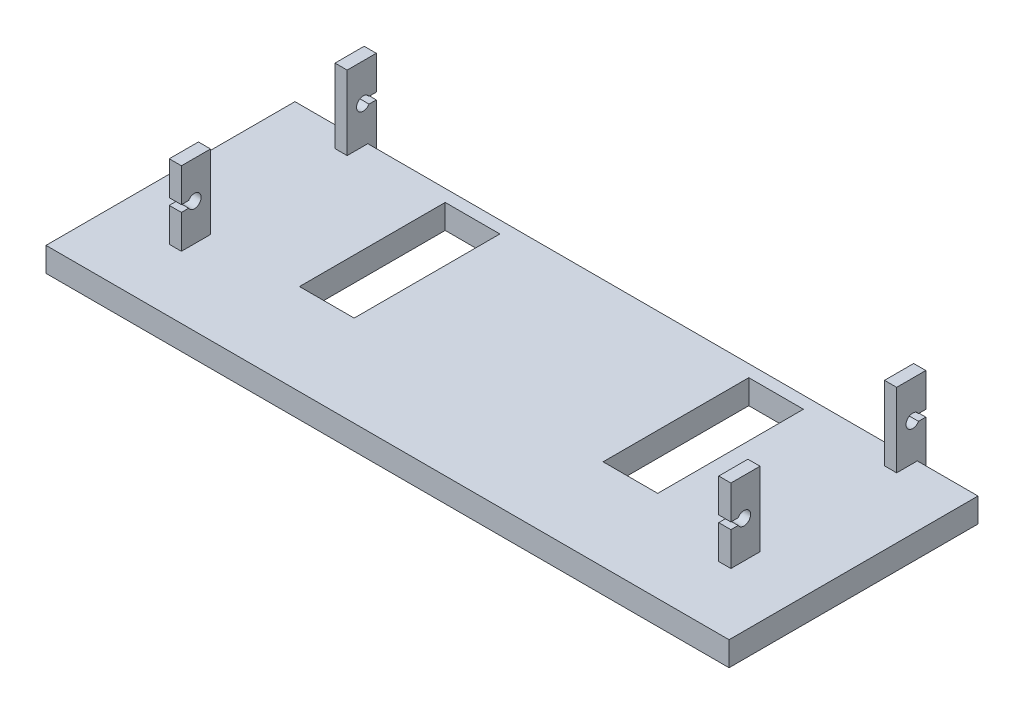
ISO-10303-21;
HEADER;
FILE_DESCRIPTION(('STEP AP214'),'2;1');
FILE_NAME('part.step','',(''),(''),'','','');
FILE_SCHEMA(('AUTOMOTIVE_DESIGN { 1 0 10303 214 1 1 1 1 }'));
ENDSEC;
DATA;
#1=APPLICATION_CONTEXT('core data for automotive mechanical design processes');
#2=APPLICATION_PROTOCOL_DEFINITION('international standard','automotive_design',2000,#1);
#3=PRODUCT_CONTEXT('',#1,'mechanical');
#4=PRODUCT('Part','Part','',(#3));
#5=PRODUCT_RELATED_PRODUCT_CATEGORY('part','',(#4));
#6=PRODUCT_DEFINITION_FORMATION('','',#4);
#7=PRODUCT_DEFINITION_CONTEXT('part definition',#1,'design');
#8=PRODUCT_DEFINITION('design','',#6,#7);
#9=PRODUCT_DEFINITION_SHAPE('','',#8);
#10=(LENGTH_UNIT() NAMED_UNIT(*) SI_UNIT(.MILLI.,.METRE.));
#11=(NAMED_UNIT(*) PLANE_ANGLE_UNIT() SI_UNIT($,.RADIAN.));
#12=(NAMED_UNIT(*) SI_UNIT($,.STERADIAN.) SOLID_ANGLE_UNIT());
#13=UNCERTAINTY_MEASURE_WITH_UNIT(LENGTH_MEASURE(1.E-05),#10,'distance_accuracy_value','');
#14=(GEOMETRIC_REPRESENTATION_CONTEXT(3) GLOBAL_UNCERTAINTY_ASSIGNED_CONTEXT((#13)) GLOBAL_UNIT_ASSIGNED_CONTEXT((#10,
#11,#12)) REPRESENTATION_CONTEXT('',''));
#15=CARTESIAN_POINT('',(0.,0.,0.));
#16=DIRECTION('',(0.,0.,1.));
#17=DIRECTION('',(1.,0.,0.));
#18=AXIS2_PLACEMENT_3D('',#15,#16,#17);
#19=CARTESIAN_POINT('',(102.5,16.2,30.7));
#20=DIRECTION('',(0.,0.,1.));
#21=DIRECTION('',(1.,0.,0.));
#22=AXIS2_PLACEMENT_3D('',#19,#20,#21);
#23=PLANE('',#22);
#24=DIRECTION('',(0.,-1.,0.));
#25=VECTOR('',#24,1.);
#26=CARTESIAN_POINT('',(100.5,16.2,30.7));
#27=LINE('',#26,#25);
#28=CARTESIAN_POINT('',(100.5,16.2,30.7));
#29=VERTEX_POINT('',#28);
#30=CARTESIAN_POINT('',(100.5,10.65,30.7));
#31=VERTEX_POINT('',#30);
#32=EDGE_CURVE('E518',#29,#31,#27,.T.);
#33=ORIENTED_EDGE('',*,*,#32,.T.);
#34=DIRECTION('',(1.,0.,0.));
#35=VECTOR('',#34,1.);
#36=CARTESIAN_POINT('',(102.5,10.65,30.7));
#37=LINE('',#36,#35);
#38=CARTESIAN_POINT('',(102.5,10.65,30.7));
#39=VERTEX_POINT('',#38);
#40=EDGE_CURVE('E988',#31,#39,#37,.T.);
#41=ORIENTED_EDGE('',*,*,#40,.T.);
#42=DIRECTION('',(0.,-1.,0.));
#43=VECTOR('',#42,1.);
#44=CARTESIAN_POINT('',(102.5,16.2,30.7));
#45=LINE('',#44,#43);
#46=CARTESIAN_POINT('',(102.5,16.2,30.7));
#47=VERTEX_POINT('',#46);
#48=EDGE_CURVE('E513',#47,#39,#45,.T.);
#49=ORIENTED_EDGE('',*,*,#48,.F.);
#50=DIRECTION('',(-1.,0.,0.));
#51=VECTOR('',#50,1.);
#52=CARTESIAN_POINT('',(102.5,16.2,30.7));
#53=LINE('',#52,#51);
#54=EDGE_CURVE('E498',#47,#29,#53,.T.);
#55=ORIENTED_EDGE('',*,*,#54,.T.);
#56=EDGE_LOOP('',(#33,#41,#49,#55));
#57=FACE_BOUND('',#56,.T.);
#58=ADVANCED_FACE('F56',(#57),#23,.T.);
#59=CARTESIAN_POINT('',(112.5,0.,-1.4));
#60=DIRECTION('',(0.,0.,-1.));
#61=DIRECTION('',(1.,0.,0.));
#62=AXIS2_PLACEMENT_3D('',#59,#60,#61);
#63=PLANE('',#62);
#64=DIRECTION('',(0.,-1.,0.));
#65=VECTOR('',#64,1.);
#66=CARTESIAN_POINT('',(100.5,4.,-1.4));
#67=LINE('',#66,#65);
#68=CARTESIAN_POINT('',(100.5,9.55,-1.4));
#69=VERTEX_POINT('',#68);
#70=CARTESIAN_POINT('',(100.5,0.,-1.4));
#71=VERTEX_POINT('',#70);
#72=EDGE_CURVE('E601',#69,#71,#67,.T.);
#73=ORIENTED_EDGE('',*,*,#72,.F.);
#74=DIRECTION('',(1.,0.,0.));
#75=VECTOR('',#74,1.);
#76=CARTESIAN_POINT('',(8.07539810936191,9.55,-1.40000000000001));
#77=LINE('',#76,#75);
#78=CARTESIAN_POINT('',(102.5,9.55,-1.4));
#79=VERTEX_POINT('',#78);
#80=EDGE_CURVE('E546',#69,#79,#77,.T.);
#81=ORIENTED_EDGE('',*,*,#80,.T.);
#82=DIRECTION('',(0.,1.,0.));
#83=VECTOR('',#82,1.);
#84=CARTESIAN_POINT('',(102.5,4.,-1.4));
#85=LINE('',#84,#83);
#86=CARTESIAN_POINT('',(102.5,0.,-1.4));
#87=VERTEX_POINT('',#86);
#88=EDGE_CURVE('E602',#87,#79,#85,.T.);
#89=ORIENTED_EDGE('',*,*,#88,.F.);
#90=DIRECTION('',(1.,0.,0.));
#91=VECTOR('',#90,1.);
#92=CARTESIAN_POINT('',(100.5,0.,-1.4));
#93=LINE('',#92,#91);
#94=EDGE_CURVE('E606',#71,#87,#93,.T.);
#95=ORIENTED_EDGE('',*,*,#94,.F.);
#96=EDGE_LOOP('',(#73,#81,#89,#95));
#97=FACE_BOUND('',#96,.T.);
#98=ADVANCED_FACE('F1081',(#97),#63,.T.);
#99=CARTESIAN_POINT('',(0.,4.,0.));
#100=DIRECTION('',(0.,0.,1.));
#101=DIRECTION('',(1.,0.,0.));
#102=AXIS2_PLACEMENT_3D('',#99,#100,#101);
#103=PLANE('',#102);
#104=DIRECTION('',(-1.,0.,0.));
#105=VECTOR('',#104,1.);
#106=CARTESIAN_POINT('',(0.,4.,0.));
#107=LINE('',#106,#105);
#108=CARTESIAN_POINT('',(100.5,4.,0.));
#109=VERTEX_POINT('',#108);
#110=CARTESIAN_POINT('',(12.,4.,0.));
#111=VERTEX_POINT('',#110);
#112=EDGE_CURVE('E953',#109,#111,#107,.T.);
#113=ORIENTED_EDGE('',*,*,#112,.F.);
#114=DIRECTION('',(0.,-1.,0.));
#115=VECTOR('',#114,1.);
#116=CARTESIAN_POINT('',(100.5,4.,0.));
#117=LINE('',#116,#115);
#118=CARTESIAN_POINT('',(100.5,0.,0.));
#119=VERTEX_POINT('',#118);
#120=EDGE_CURVE('E595',#109,#119,#117,.T.);
#121=ORIENTED_EDGE('',*,*,#120,.T.);
#122=DIRECTION('',(-1.,0.,0.));
#123=VECTOR('',#122,1.);
#124=CARTESIAN_POINT('',(0.,0.,0.));
#125=LINE('',#124,#123);
#126=CARTESIAN_POINT('',(12.,0.,0.));
#127=VERTEX_POINT('',#126);
#128=EDGE_CURVE('E966',#119,#127,#125,.T.);
#129=ORIENTED_EDGE('',*,*,#128,.T.);
#130=DIRECTION('',(0.,-1.,0.));
#131=VECTOR('',#130,1.);
#132=CARTESIAN_POINT('',(12.,4.,0.));
#133=LINE('',#132,#131);
#134=EDGE_CURVE('E774',#111,#127,#133,.T.);
#135=ORIENTED_EDGE('',*,*,#134,.F.);
#136=EDGE_LOOP('',(#113,#121,#129,#135));
#137=FACE_BOUND('',#136,.T.);
#138=ADVANCED_FACE('F1026',(#137),#103,.F.);
#139=CARTESIAN_POINT('',(10.,16.2,30.7));
#140=DIRECTION('',(0.,0.,-1.));
#141=DIRECTION('',(-1.,0.,0.));
#142=AXIS2_PLACEMENT_3D('',#139,#140,#141);
#143=PLANE('',#142);
#144=DIRECTION('',(-1.,0.,0.));
#145=VECTOR('',#144,1.);
#146=CARTESIAN_POINT('',(15.9246018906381,9.55,30.7));
#147=LINE('',#146,#145);
#148=CARTESIAN_POINT('',(12.,9.55,30.7));
#149=VERTEX_POINT('',#148);
#150=CARTESIAN_POINT('',(10.,9.55,30.7));
#151=VERTEX_POINT('',#150);
#152=EDGE_CURVE('E641',#149,#151,#147,.T.);
#153=ORIENTED_EDGE('',*,*,#152,.T.);
#154=DIRECTION('',(0.,-1.,0.));
#155=VECTOR('',#154,1.);
#156=CARTESIAN_POINT('',(10.,16.2,30.7));
#157=LINE('',#156,#155);
#158=CARTESIAN_POINT('',(10.,4.,30.7));
#159=VERTEX_POINT('',#158);
#160=EDGE_CURVE('E700',#151,#159,#157,.T.);
#161=ORIENTED_EDGE('',*,*,#160,.T.);
#162=DIRECTION('',(1.,0.,0.));
#163=VECTOR('',#162,1.);
#164=CARTESIAN_POINT('',(10.,4.,30.7));
#165=LINE('',#164,#163);
#166=CARTESIAN_POINT('',(12.,4.,30.7));
#167=VERTEX_POINT('',#166);
#168=EDGE_CURVE('E679',#159,#167,#165,.T.);
#169=ORIENTED_EDGE('',*,*,#168,.T.);
#170=DIRECTION('',(0.,-1.,0.));
#171=VECTOR('',#170,1.);
#172=CARTESIAN_POINT('',(12.,16.2,30.7));
#173=LINE('',#172,#171);
#174=EDGE_CURVE('E695',#149,#167,#173,.T.);
#175=ORIENTED_EDGE('',*,*,#174,.F.);
#176=EDGE_LOOP('',(#153,#161,#169,#175));
#177=FACE_BOUND('',#176,.T.);
#178=ADVANCED_FACE('F1294',(#177),#143,.F.);
#179=CARTESIAN_POINT('',(0.,4.,0.));
#180=DIRECTION('',(0.,1.,0.));
#181=DIRECTION('',(0.,0.,1.));
#182=AXIS2_PLACEMENT_3D('',#179,#180,#181);
#183=PLANE('',#182);
#184=DIRECTION('',(0.,0.,1.));
#185=VECTOR('',#184,1.);
#186=CARTESIAN_POINT('',(26.75,4.,15.));
#187=LINE('',#186,#185);
#188=CARTESIAN_POINT('',(26.75,4.,2.));
#189=VERTEX_POINT('',#188);
#190=CARTESIAN_POINT('',(26.75,4.,26.));
#191=VERTEX_POINT('',#190);
#192=EDGE_CURVE('E422',#189,#191,#187,.T.);
#193=ORIENTED_EDGE('',*,*,#192,.F.);
#194=DIRECTION('',(-1.,0.,0.));
#195=VECTOR('',#194,1.);
#196=CARTESIAN_POINT('',(26.75,4.,2.));
#197=LINE('',#196,#195);
#198=CARTESIAN_POINT('',(35.75,4.,2.));
#199=VERTEX_POINT('',#198);
#200=EDGE_CURVE('E439',#199,#189,#197,.T.);
#201=ORIENTED_EDGE('',*,*,#200,.F.);
#202=DIRECTION('',(0.,0.,-1.));
#203=VECTOR('',#202,1.);
#204=CARTESIAN_POINT('',(35.75,4.,15.));
#205=LINE('',#204,#203);
#206=CARTESIAN_POINT('',(35.75,4.,26.));
#207=VERTEX_POINT('',#206);
#208=EDGE_CURVE('E428',#207,#199,#205,.T.);
#209=ORIENTED_EDGE('',*,*,#208,.F.);
#210=DIRECTION('',(1.,0.,0.));
#211=VECTOR('',#210,1.);
#212=CARTESIAN_POINT('',(26.75,4.,26.));
#213=LINE('',#212,#211);
#214=EDGE_CURVE('E892',#191,#207,#213,.T.);
#215=ORIENTED_EDGE('',*,*,#214,.F.);
#216=EDGE_LOOP('',(#193,#201,#209,#215));
#217=FACE_BOUND('',#216,.T.);
#218=DIRECTION('',(-1.,0.,0.));
#219=VECTOR('',#218,1.);
#220=CARTESIAN_POINT('',(85.75,4.,2.));
#221=LINE('',#220,#219);
#222=CARTESIAN_POINT('',(85.75,4.,2.));
#223=VERTEX_POINT('',#222);
#224=CARTESIAN_POINT('',(76.75,4.,2.));
#225=VERTEX_POINT('',#224);
#226=EDGE_CURVE('E442',#223,#225,#221,.T.);
#227=ORIENTED_EDGE('',*,*,#226,.F.);
#228=DIRECTION('',(0.,0.,-1.));
#229=VECTOR('',#228,1.);
#230=CARTESIAN_POINT('',(85.75,4.,15.));
#231=LINE('',#230,#229);
#232=CARTESIAN_POINT('',(85.75,4.,26.));
#233=VERTEX_POINT('',#232);
#234=EDGE_CURVE('E917',#233,#223,#231,.T.);
#235=ORIENTED_EDGE('',*,*,#234,.F.);
#236=DIRECTION('',(1.,0.,0.));
#237=VECTOR('',#236,1.);
#238=CARTESIAN_POINT('',(76.75,4.,26.));
#239=LINE('',#238,#237);
#240=CARTESIAN_POINT('',(76.75,4.,26.));
#241=VERTEX_POINT('',#240);
#242=EDGE_CURVE('E931',#241,#233,#239,.T.);
#243=ORIENTED_EDGE('',*,*,#242,.F.);
#244=DIRECTION('',(0.,0.,1.));
#245=VECTOR('',#244,1.);
#246=CARTESIAN_POINT('',(76.75,4.,15.));
#247=LINE('',#246,#245);
#248=EDGE_CURVE('E922',#225,#241,#247,.T.);
#249=ORIENTED_EDGE('',*,*,#248,.F.);
#250=EDGE_LOOP('',(#227,#235,#243,#249));
#251=FACE_BOUND('',#250,.T.);
#252=DIRECTION('',(0.,0.,1.));
#253=VECTOR('',#252,1.);
#254=CARTESIAN_POINT('',(102.5,4.,25.9));
#255=LINE('',#254,#253);
#256=CARTESIAN_POINT('',(102.5,4.,25.9));
#257=VERTEX_POINT('',#256);
#258=CARTESIAN_POINT('',(102.5,4.,30.7));
#259=VERTEX_POINT('',#258);
#260=EDGE_CURVE('E484',#257,#259,#255,.T.);
#261=ORIENTED_EDGE('',*,*,#260,.T.);
#262=DIRECTION('',(-1.,0.,0.));
#263=VECTOR('',#262,1.);
#264=CARTESIAN_POINT('',(102.5,4.,30.7));
#265=LINE('',#264,#263);
#266=CARTESIAN_POINT('',(100.5,4.,30.7));
#267=VERTEX_POINT('',#266);
#268=EDGE_CURVE('E490',#259,#267,#265,.T.);
#269=ORIENTED_EDGE('',*,*,#268,.T.);
#270=DIRECTION('',(0.,0.,-1.));
#271=VECTOR('',#270,1.);
#272=CARTESIAN_POINT('',(100.5,4.,25.9));
#273=LINE('',#272,#271);
#274=CARTESIAN_POINT('',(100.5,4.,25.9));
#275=VERTEX_POINT('',#274);
#276=EDGE_CURVE('E507',#267,#275,#273,.T.);
#277=ORIENTED_EDGE('',*,*,#276,.T.);
#278=DIRECTION('',(1.,0.,0.));
#279=VECTOR('',#278,1.);
#280=CARTESIAN_POINT('',(102.5,4.,25.9));
#281=LINE('',#280,#279);
#282=EDGE_CURVE('E80',#275,#257,#281,.T.);
#283=ORIENTED_EDGE('',*,*,#282,.T.);
#284=EDGE_LOOP('',(#261,#269,#277,#283));
#285=FACE_BOUND('',#284,.T.);
#286=DIRECTION('',(0.,0.,1.));
#287=VECTOR('',#286,1.);
#288=CARTESIAN_POINT('',(102.5,4.,-1.4));
#289=LINE('',#288,#287);
#290=CARTESIAN_POINT('',(102.5,4.,0.));
#291=VERTEX_POINT('',#290);
#292=CARTESIAN_POINT('',(102.5,4.,3.4));
#293=VERTEX_POINT('',#292);
#294=EDGE_CURVE('E562',#291,#293,#289,.T.);
#295=ORIENTED_EDGE('',*,*,#294,.T.);
#296=DIRECTION('',(-1.,0.,0.));
#297=VECTOR('',#296,1.);
#298=CARTESIAN_POINT('',(102.5,4.,3.4));
#299=LINE('',#298,#297);
#300=CARTESIAN_POINT('',(100.5,4.,3.4));
#301=VERTEX_POINT('',#300);
#302=EDGE_CURVE('E568',#293,#301,#299,.T.);
#303=ORIENTED_EDGE('',*,*,#302,.T.);
#304=DIRECTION('',(0.,0.,-1.));
#305=VECTOR('',#304,1.);
#306=CARTESIAN_POINT('',(100.5,4.,-1.4));
#307=LINE('',#306,#305);
#308=EDGE_CURVE('E583',#301,#109,#307,.T.);
#309=ORIENTED_EDGE('',*,*,#308,.T.);
#310=ORIENTED_EDGE('',*,*,#112,.T.);
#311=DIRECTION('',(0.,0.,-1.));
#312=VECTOR('',#311,1.);
#313=CARTESIAN_POINT('',(12.,4.,-1.4));
#314=LINE('',#313,#312);
#315=CARTESIAN_POINT('',(12.,4.,3.4));
#316=VERTEX_POINT('',#315);
#317=EDGE_CURVE('E743',#316,#111,#314,.T.);
#318=ORIENTED_EDGE('',*,*,#317,.F.);
#319=DIRECTION('',(1.,0.,0.));
#320=VECTOR('',#319,1.);
#321=CARTESIAN_POINT('',(10.,4.,3.4));
#322=LINE('',#321,#320);
#323=CARTESIAN_POINT('',(10.,4.,3.4));
#324=VERTEX_POINT('',#323);
#325=EDGE_CURVE('E737',#324,#316,#322,.T.);
#326=ORIENTED_EDGE('',*,*,#325,.F.);
#327=DIRECTION('',(0.,0.,1.));
#328=VECTOR('',#327,1.);
#329=CARTESIAN_POINT('',(10.,4.,-1.4));
#330=LINE('',#329,#328);
#331=CARTESIAN_POINT('',(10.,4.,0.));
#332=VERTEX_POINT('',#331);
#333=EDGE_CURVE('E755',#332,#324,#330,.T.);
#334=ORIENTED_EDGE('',*,*,#333,.F.);
#335=CARTESIAN_POINT('',(0.,4.,0.));
#336=VERTEX_POINT('',#335);
#337=EDGE_CURVE('E947',#332,#336,#107,.T.);
#338=ORIENTED_EDGE('',*,*,#337,.T.);
#339=DIRECTION('',(0.,0.,1.));
#340=VECTOR('',#339,1.);
#341=CARTESIAN_POINT('',(0.,4.,0.));
#342=LINE('',#341,#340);
#343=CARTESIAN_POINT('',(0.,4.,41.));
#344=VERTEX_POINT('',#343);
#345=EDGE_CURVE('E936',#336,#344,#342,.T.);
#346=ORIENTED_EDGE('',*,*,#345,.T.);
#347=DIRECTION('',(1.,0.,0.));
#348=VECTOR('',#347,1.);
#349=CARTESIAN_POINT('',(0.,4.,41.));
#350=LINE('',#349,#348);
#351=CARTESIAN_POINT('',(112.5,4.,41.));
#352=VERTEX_POINT('',#351);
#353=EDGE_CURVE('E940',#344,#352,#350,.T.);
#354=ORIENTED_EDGE('',*,*,#353,.T.);
#355=DIRECTION('',(0.,0.,-1.));
#356=VECTOR('',#355,1.);
#357=CARTESIAN_POINT('',(112.5,4.,0.));
#358=LINE('',#357,#356);
#359=CARTESIAN_POINT('',(112.5,4.,0.));
#360=VERTEX_POINT('',#359);
#361=EDGE_CURVE('E944',#352,#360,#358,.T.);
#362=ORIENTED_EDGE('',*,*,#361,.T.);
#363=EDGE_CURVE('E948',#360,#291,#107,.T.);
#364=ORIENTED_EDGE('',*,*,#363,.T.);
#365=EDGE_LOOP('',(#295,#303,#309,#310,#318,#326,#334,#338,#346,#354,#362,#364));
#366=FACE_BOUND('',#365,.T.);
#367=ORIENTED_EDGE('',*,*,#168,.F.);
#368=DIRECTION('',(0.,0.,1.));
#369=VECTOR('',#368,1.);
#370=CARTESIAN_POINT('',(10.,4.,25.9));
#371=LINE('',#370,#369);
#372=CARTESIAN_POINT('',(10.,4.,25.9));
#373=VERTEX_POINT('',#372);
#374=EDGE_CURVE('E660',#373,#159,#371,.T.);
#375=ORIENTED_EDGE('',*,*,#374,.F.);
#376=DIRECTION('',(-1.,0.,0.));
#377=VECTOR('',#376,1.);
#378=CARTESIAN_POINT('',(10.,4.,25.9));
#379=LINE('',#378,#377);
#380=CARTESIAN_POINT('',(12.,4.,25.9));
#381=VERTEX_POINT('',#380);
#382=EDGE_CURVE('E666',#381,#373,#379,.T.);
#383=ORIENTED_EDGE('',*,*,#382,.F.);
#384=DIRECTION('',(0.,0.,-1.));
#385=VECTOR('',#384,1.);
#386=CARTESIAN_POINT('',(12.,4.,25.9));
#387=LINE('',#386,#385);
#388=EDGE_CURVE('E683',#167,#381,#387,.T.);
#389=ORIENTED_EDGE('',*,*,#388,.F.);
#390=EDGE_LOOP('',(#367,#375,#383,#389));
#391=FACE_BOUND('',#390,.T.);
#392=ADVANCED_FACE('F1021',(#217,#251,#285,#366,#391),#183,.T.);
#393=CARTESIAN_POINT('',(12.,4.,-1.4));
#394=DIRECTION('',(-1.,0.,0.));
#395=DIRECTION('',(0.,-1.,0.));
#396=AXIS2_PLACEMENT_3D('',#393,#394,#395);
#397=PLANE('',#396);
#398=DIRECTION('',(0.,0.,-1.));
#399=VECTOR('',#398,1.);
#400=CARTESIAN_POINT('',(12.,10.65,0.));
#401=LINE('',#400,#399);
#402=CARTESIAN_POINT('',(12.,10.65,-0.202627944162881));
#403=VERTEX_POINT('',#402);
#404=CARTESIAN_POINT('',(12.,10.65,-1.4));
#405=VERTEX_POINT('',#404);
#406=EDGE_CURVE('E710',#403,#405,#401,.T.);
#407=ORIENTED_EDGE('',*,*,#406,.T.);
#408=DIRECTION('',(0.,-1.,0.));
#409=VECTOR('',#408,1.);
#410=CARTESIAN_POINT('',(12.,4.,-1.4));
#411=LINE('',#410,#409);
#412=CARTESIAN_POINT('',(12.,16.2,-1.4));
#413=VERTEX_POINT('',#412);
#414=EDGE_CURVE('E775',#413,#405,#411,.T.);
#415=ORIENTED_EDGE('',*,*,#414,.F.);
#416=DIRECTION('',(0.,0.,-1.));
#417=VECTOR('',#416,1.);
#418=CARTESIAN_POINT('',(12.,16.2,-1.4));
#419=LINE('',#418,#417);
#420=CARTESIAN_POINT('',(12.,16.2,3.4));
#421=VERTEX_POINT('',#420);
#422=EDGE_CURVE('E746',#421,#413,#419,.T.);
#423=ORIENTED_EDGE('',*,*,#422,.F.);
#424=DIRECTION('',(0.,-1.,0.));
#425=VECTOR('',#424,1.);
#426=CARTESIAN_POINT('',(12.,16.2,3.4));
#427=LINE('',#426,#425);
#428=EDGE_CURVE('E754',#421,#316,#427,.T.);
#429=ORIENTED_EDGE('',*,*,#428,.T.);
#430=ORIENTED_EDGE('',*,*,#317,.T.);
#431=ORIENTED_EDGE('',*,*,#134,.T.);
#432=DIRECTION('',(0.,0.,1.));
#433=VECTOR('',#432,1.);
#434=CARTESIAN_POINT('',(12.,0.,-1.4));
#435=LINE('',#434,#433);
#436=CARTESIAN_POINT('',(12.,0.,-1.4));
#437=VERTEX_POINT('',#436);
#438=EDGE_CURVE('E799',#437,#127,#435,.T.);
#439=ORIENTED_EDGE('',*,*,#438,.F.);
#440=CARTESIAN_POINT('',(12.,9.55,-1.4));
#441=VERTEX_POINT('',#440);
#442=EDGE_CURVE('E780',#441,#437,#411,.T.);
#443=ORIENTED_EDGE('',*,*,#442,.F.);
#444=DIRECTION('',(0.,0.,-1.));
#445=VECTOR('',#444,1.);
#446=CARTESIAN_POINT('',(12.,9.55,0.));
#447=LINE('',#446,#445);
#448=CARTESIAN_POINT('',(12.,9.55,-0.202627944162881));
#449=VERTEX_POINT('',#448);
#450=EDGE_CURVE('E706',#449,#441,#447,.T.);
#451=ORIENTED_EDGE('',*,*,#450,.F.);
#452=CARTESIAN_POINT('',(12.,10.1,0.75));
#453=DIRECTION('',(-1.,0.,0.));
#454=DIRECTION('',(0.,-1.,0.));
#455=AXIS2_PLACEMENT_3D('',#452,#453,#454);
#456=CIRCLE('',#455,1.1);
#457=EDGE_CURVE('E709',#403,#449,#456,.F.);
#458=ORIENTED_EDGE('',*,*,#457,.F.);
#459=EDGE_LOOP('',(#407,#415,#423,#429,#430,#431,#439,#443,#451,#458));
#460=FACE_BOUND('',#459,.T.);
#461=ADVANCED_FACE('F1029',(#460),#397,.F.);
#462=CARTESIAN_POINT('',(10.,4.,-1.4));
#463=DIRECTION('',(1.,0.,0.));
#464=DIRECTION('',(0.,1.,0.));
#465=AXIS2_PLACEMENT_3D('',#462,#463,#464);
#466=PLANE('',#465);
#467=DIRECTION('',(0.,0.,-1.));
#468=VECTOR('',#467,1.);
#469=CARTESIAN_POINT('',(10.,10.65,-1.40000000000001));
#470=LINE('',#469,#468);
#471=CARTESIAN_POINT('',(10.,10.65,-0.202627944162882));
#472=VERTEX_POINT('',#471);
#473=CARTESIAN_POINT('',(9.99999999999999,10.65,-1.4));
#474=VERTEX_POINT('',#473);
#475=EDGE_CURVE('E734',#472,#474,#470,.T.);
#476=ORIENTED_EDGE('',*,*,#475,.F.);
#477=CARTESIAN_POINT('',(10.,10.1,0.75));
#478=DIRECTION('',(1.,0.,0.));
#479=DIRECTION('',(0.,1.,0.));
#480=AXIS2_PLACEMENT_3D('',#477,#478,#479);
#481=CIRCLE('',#480,1.1);
#482=CARTESIAN_POINT('',(10.,9.55,-0.202627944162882));
#483=VERTEX_POINT('',#482);
#484=EDGE_CURVE('E759',#472,#483,#481,.T.);
#485=ORIENTED_EDGE('',*,*,#484,.T.);
#486=DIRECTION('',(0.,0.,-1.));
#487=VECTOR('',#486,1.);
#488=CARTESIAN_POINT('',(10.,9.55,-1.4));
#489=LINE('',#488,#487);
#490=CARTESIAN_POINT('',(9.99999999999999,9.55,-1.4));
#491=VERTEX_POINT('',#490);
#492=EDGE_CURVE('E713',#483,#491,#489,.T.);
#493=ORIENTED_EDGE('',*,*,#492,.T.);
#494=DIRECTION('',(0.,1.,0.));
#495=VECTOR('',#494,1.);
#496=CARTESIAN_POINT('',(10.,4.,-1.4));
#497=LINE('',#496,#495);
#498=CARTESIAN_POINT('',(9.99999999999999,0.,-1.4));
#499=VERTEX_POINT('',#498);
#500=EDGE_CURVE('E784',#499,#491,#497,.T.);
#501=ORIENTED_EDGE('',*,*,#500,.F.);
#502=DIRECTION('',(0.,0.,1.));
#503=VECTOR('',#502,1.);
#504=CARTESIAN_POINT('',(9.99999999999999,0.,-1.4));
#505=LINE('',#504,#503);
#506=CARTESIAN_POINT('',(10.,0.,0.));
#507=VERTEX_POINT('',#506);
#508=EDGE_CURVE('E788',#499,#507,#505,.T.);
#509=ORIENTED_EDGE('',*,*,#508,.T.);
#510=DIRECTION('',(0.,1.,0.));
#511=VECTOR('',#510,1.);
#512=CARTESIAN_POINT('',(10.,4.,0.));
#513=LINE('',#512,#511);
#514=EDGE_CURVE('E792',#507,#332,#513,.T.);
#515=ORIENTED_EDGE('',*,*,#514,.T.);
#516=ORIENTED_EDGE('',*,*,#333,.T.);
#517=DIRECTION('',(0.,-1.,0.));
#518=VECTOR('',#517,1.);
#519=CARTESIAN_POINT('',(10.,16.2,3.4));
#520=LINE('',#519,#518);
#521=CARTESIAN_POINT('',(10.,16.2,3.4));
#522=VERTEX_POINT('',#521);
#523=EDGE_CURVE('E770',#522,#324,#520,.T.);
#524=ORIENTED_EDGE('',*,*,#523,.F.);
#525=DIRECTION('',(0.,0.,1.));
#526=VECTOR('',#525,1.);
#527=CARTESIAN_POINT('',(10.,16.2,-1.4));
#528=LINE('',#527,#526);
#529=CARTESIAN_POINT('',(10.,16.2,-1.4));
#530=VERTEX_POINT('',#529);
#531=EDGE_CURVE('E738',#530,#522,#528,.T.);
#532=ORIENTED_EDGE('',*,*,#531,.F.);
#533=EDGE_CURVE('E783',#474,#530,#497,.T.);
#534=ORIENTED_EDGE('',*,*,#533,.F.);
#535=EDGE_LOOP('',(#476,#485,#493,#501,#509,#515,#516,#524,#532,#534));
#536=FACE_BOUND('',#535,.T.);
#537=ADVANCED_FACE('F1038',(#536),#466,.F.);
#538=CARTESIAN_POINT('',(0.,0.,-1.4));
#539=DIRECTION('',(0.,0.,-1.));
#540=DIRECTION('',(-1.,0.,0.));
#541=AXIS2_PLACEMENT_3D('',#538,#539,#540);
#542=PLANE('',#541);
#543=ORIENTED_EDGE('',*,*,#414,.T.);
#544=DIRECTION('',(-1.,0.,0.));
#545=VECTOR('',#544,1.);
#546=CARTESIAN_POINT('',(15.9246018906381,10.65,-1.4));
#547=LINE('',#546,#545);
#548=EDGE_CURVE('E721',#405,#474,#547,.T.);
#549=ORIENTED_EDGE('',*,*,#548,.T.);
#550=ORIENTED_EDGE('',*,*,#533,.T.);
#551=DIRECTION('',(-1.,0.,0.));
#552=VECTOR('',#551,1.);
#553=CARTESIAN_POINT('',(10.,16.2,-1.4));
#554=LINE('',#553,#552);
#555=EDGE_CURVE('E750',#413,#530,#554,.T.);
#556=ORIENTED_EDGE('',*,*,#555,.F.);
#557=EDGE_LOOP('',(#543,#549,#550,#556));
#558=FACE_BOUND('',#557,.T.);
#559=ADVANCED_FACE('F1299',(#558),#542,.T.);
#560=CARTESIAN_POINT('',(112.5,0.,0.));
#561=VERTEX_POINT('',#560);
#562=CARTESIAN_POINT('',(102.5,0.,0.));
#563=VERTEX_POINT('',#562);
#564=EDGE_CURVE('E941',#561,#563,#125,.T.);
#565=ORIENTED_EDGE('',*,*,#564,.T.);
#566=DIRECTION('',(0.,1.,0.));
#567=VECTOR('',#566,1.);
#568=CARTESIAN_POINT('',(102.5,4.,0.));
#569=LINE('',#568,#567);
#570=EDGE_CURVE('E614',#563,#291,#569,.T.);
#571=ORIENTED_EDGE('',*,*,#570,.T.);
#572=ORIENTED_EDGE('',*,*,#363,.F.);
#573=DIRECTION('',(0.,-1.,0.));
#574=VECTOR('',#573,1.);
#575=CARTESIAN_POINT('',(112.5,4.,0.));
#576=LINE('',#575,#574);
#577=EDGE_CURVE('E970',#360,#561,#576,.T.);
#578=ORIENTED_EDGE('',*,*,#577,.T.);
#579=EDGE_LOOP('',(#565,#571,#572,#578));
#580=FACE_BOUND('',#579,.T.);
#581=ADVANCED_FACE('F1063',(#580),#103,.F.);
#582=ORIENTED_EDGE('',*,*,#514,.F.);
#583=CARTESIAN_POINT('',(0.,0.,0.));
#584=VERTEX_POINT('',#583);
#585=EDGE_CURVE('E963',#507,#584,#125,.T.);
#586=ORIENTED_EDGE('',*,*,#585,.T.);
#587=DIRECTION('',(0.,-1.,0.));
#588=VECTOR('',#587,1.);
#589=CARTESIAN_POINT('',(0.,4.,0.));
#590=LINE('',#589,#588);
#591=EDGE_CURVE('E952',#336,#584,#590,.T.);
#592=ORIENTED_EDGE('',*,*,#591,.F.);
#593=ORIENTED_EDGE('',*,*,#337,.F.);
#594=EDGE_LOOP('',(#582,#586,#592,#593));
#595=FACE_BOUND('',#594,.T.);
#596=ADVANCED_FACE('F1044',(#595),#103,.F.);
#597=CARTESIAN_POINT('',(0.,0.,0.));
#598=DIRECTION('',(0.,1.,0.));
#599=DIRECTION('',(0.,0.,1.));
#600=AXIS2_PLACEMENT_3D('',#597,#598,#599);
#601=PLANE('',#600);
#602=DIRECTION('',(0.,0.,-1.));
#603=VECTOR('',#602,1.);
#604=CARTESIAN_POINT('',(85.75,0.,15.));
#605=LINE('',#604,#603);
#606=CARTESIAN_POINT('',(85.75,0.,26.));
#607=VERTEX_POINT('',#606);
#608=CARTESIAN_POINT('',(85.75,0.,2.));
#609=VERTEX_POINT('',#608);
#610=EDGE_CURVE('E918',#607,#609,#605,.T.);
#611=ORIENTED_EDGE('',*,*,#610,.T.);
#612=DIRECTION('',(-1.,0.,0.));
#613=VECTOR('',#612,1.);
#614=CARTESIAN_POINT('',(85.75,0.,2.));
#615=LINE('',#614,#613);
#616=CARTESIAN_POINT('',(76.75,0.,2.));
#617=VERTEX_POINT('',#616);
#618=EDGE_CURVE('E452',#609,#617,#615,.T.);
#619=ORIENTED_EDGE('',*,*,#618,.T.);
#620=DIRECTION('',(0.,0.,1.));
#621=VECTOR('',#620,1.);
#622=CARTESIAN_POINT('',(76.75,0.,15.));
#623=LINE('',#622,#621);
#624=CARTESIAN_POINT('',(76.75,0.,26.));
#625=VERTEX_POINT('',#624);
#626=EDGE_CURVE('E901',#617,#625,#623,.T.);
#627=ORIENTED_EDGE('',*,*,#626,.T.);
#628=DIRECTION('',(1.,0.,0.));
#629=VECTOR('',#628,1.);
#630=CARTESIAN_POINT('',(76.75,0.,26.));
#631=LINE('',#630,#629);
#632=EDGE_CURVE('E921',#625,#607,#631,.T.);
#633=ORIENTED_EDGE('',*,*,#632,.T.);
#634=EDGE_LOOP('',(#611,#619,#627,#633));
#635=FACE_BOUND('',#634,.T.);
#636=DIRECTION('',(-1.,0.,0.));
#637=VECTOR('',#636,1.);
#638=CARTESIAN_POINT('',(41.9242363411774,0.,31.4313302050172));
#639=LINE('',#638,#637);
#640=CARTESIAN_POINT('',(35.75,0.,31.4313302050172));
#641=VERTEX_POINT('',#640);
#642=CARTESIAN_POINT('',(26.75,0.,31.4313302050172));
#643=VERTEX_POINT('',#642);
#644=EDGE_CURVE('E835',#641,#643,#639,.T.);
#645=ORIENTED_EDGE('',*,*,#644,.T.);
#646=DIRECTION('',(0.,0.,-1.));
#647=VECTOR('',#646,1.);
#648=CARTESIAN_POINT('',(26.75,0.,36.6305696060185));
#649=LINE('',#648,#647);
#650=CARTESIAN_POINT('',(26.75,0.,36.6305696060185));
#651=VERTEX_POINT('',#650);
#652=EDGE_CURVE('E825',#651,#643,#649,.T.);
#653=ORIENTED_EDGE('',*,*,#652,.F.);
#654=DIRECTION('',(-1.,0.,0.));
#655=VECTOR('',#654,1.);
#656=CARTESIAN_POINT('',(41.9242363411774,0.,36.6305696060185));
#657=LINE('',#656,#655);
#658=CARTESIAN_POINT('',(35.75,0.,36.6305696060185));
#659=VERTEX_POINT('',#658);
#660=EDGE_CURVE('E839',#659,#651,#657,.T.);
#661=ORIENTED_EDGE('',*,*,#660,.F.);
#662=DIRECTION('',(0.,0.,1.));
#663=VECTOR('',#662,1.);
#664=CARTESIAN_POINT('',(35.75,0.,36.6305696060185));
#665=LINE('',#664,#663);
#666=EDGE_CURVE('E804',#641,#659,#665,.T.);
#667=ORIENTED_EDGE('',*,*,#666,.F.);
#668=EDGE_LOOP('',(#645,#653,#661,#667));
#669=FACE_BOUND('',#668,.T.);
#670=DIRECTION('',(-1.,0.,0.));
#671=VECTOR('',#670,1.);
#672=CARTESIAN_POINT('',(91.9242363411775,0.,31.4313302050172));
#673=LINE('',#672,#671);
#674=CARTESIAN_POINT('',(85.75,0.,31.4313302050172));
#675=VERTEX_POINT('',#674);
#676=CARTESIAN_POINT('',(76.75,0.,31.4313302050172));
#677=VERTEX_POINT('',#676);
#678=EDGE_CURVE('E878',#675,#677,#673,.T.);
#679=ORIENTED_EDGE('',*,*,#678,.T.);
#680=DIRECTION('',(0.,0.,-1.));
#681=VECTOR('',#680,1.);
#682=CARTESIAN_POINT('',(76.75,0.,36.6305696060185));
#683=LINE('',#682,#681);
#684=CARTESIAN_POINT('',(76.75,0.,36.6305696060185));
#685=VERTEX_POINT('',#684);
#686=EDGE_CURVE('E868',#685,#677,#683,.T.);
#687=ORIENTED_EDGE('',*,*,#686,.F.);
#688=DIRECTION('',(-1.,0.,0.));
#689=VECTOR('',#688,1.);
#690=CARTESIAN_POINT('',(91.9242363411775,0.,36.6305696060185));
#691=LINE('',#690,#689);
#692=CARTESIAN_POINT('',(85.75,0.,36.6305696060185));
#693=VERTEX_POINT('',#692);
#694=EDGE_CURVE('E882',#693,#685,#691,.T.);
#695=ORIENTED_EDGE('',*,*,#694,.F.);
#696=DIRECTION('',(0.,0.,1.));
#697=VECTOR('',#696,1.);
#698=CARTESIAN_POINT('',(85.75,0.,36.6305696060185));
#699=LINE('',#698,#697);
#700=EDGE_CURVE('E847',#675,#693,#699,.T.);
#701=ORIENTED_EDGE('',*,*,#700,.F.);
#702=EDGE_LOOP('',(#679,#687,#695,#701));
#703=FACE_BOUND('',#702,.T.);
#704=DIRECTION('',(0.,0.,1.));
#705=VECTOR('',#704,1.);
#706=CARTESIAN_POINT('',(0.,0.,0.));
#707=LINE('',#706,#705);
#708=CARTESIAN_POINT('',(0.,0.,41.));
#709=VERTEX_POINT('',#708);
#710=EDGE_CURVE('E910',#584,#709,#707,.T.);
#711=ORIENTED_EDGE('',*,*,#710,.F.);
#712=ORIENTED_EDGE('',*,*,#585,.F.);
#713=ORIENTED_EDGE('',*,*,#508,.F.);
#714=DIRECTION('',(-1.,0.,0.));
#715=VECTOR('',#714,1.);
#716=CARTESIAN_POINT('',(12.,0.,-1.4));
#717=LINE('',#716,#715);
#718=EDGE_CURVE('E779',#437,#499,#717,.T.);
#719=ORIENTED_EDGE('',*,*,#718,.F.);
#720=ORIENTED_EDGE('',*,*,#438,.T.);
#721=ORIENTED_EDGE('',*,*,#128,.F.);
#722=DIRECTION('',(0.,0.,1.));
#723=VECTOR('',#722,1.);
#724=CARTESIAN_POINT('',(100.5,0.,-1.4));
#725=LINE('',#724,#723);
#726=EDGE_CURVE('E610',#71,#119,#725,.T.);
#727=ORIENTED_EDGE('',*,*,#726,.F.);
#728=ORIENTED_EDGE('',*,*,#94,.T.);
#729=DIRECTION('',(0.,0.,1.));
#730=VECTOR('',#729,1.);
#731=CARTESIAN_POINT('',(102.5,0.,-1.4));
#732=LINE('',#731,#730);
#733=EDGE_CURVE('E620',#87,#563,#732,.T.);
#734=ORIENTED_EDGE('',*,*,#733,.T.);
#735=ORIENTED_EDGE('',*,*,#564,.F.);
#736=DIRECTION('',(0.,0.,-1.));
#737=VECTOR('',#736,1.);
#738=CARTESIAN_POINT('',(112.5,0.,0.));
#739=LINE('',#738,#737);
#740=CARTESIAN_POINT('',(112.5,0.,41.));
#741=VERTEX_POINT('',#740);
#742=EDGE_CURVE('E960',#741,#561,#739,.T.);
#743=ORIENTED_EDGE('',*,*,#742,.F.);
#744=DIRECTION('',(1.,0.,0.));
#745=VECTOR('',#744,1.);
#746=CARTESIAN_POINT('',(0.,0.,41.));
#747=LINE('',#746,#745);
#748=EDGE_CURVE('E957',#709,#741,#747,.T.);
#749=ORIENTED_EDGE('',*,*,#748,.F.);
#750=EDGE_LOOP('',(#711,#712,#713,#719,#720,#721,#727,#728,#734,#735,#743,#749));
#751=FACE_BOUND('',#750,.T.);
#752=DIRECTION('',(-1.,0.,0.));
#753=VECTOR('',#752,1.);
#754=CARTESIAN_POINT('',(26.75,0.,2.));
#755=LINE('',#754,#753);
#756=CARTESIAN_POINT('',(35.75,0.,2.));
#757=VERTEX_POINT('',#756);
#758=CARTESIAN_POINT('',(26.75,0.,2.));
#759=VERTEX_POINT('',#758);
#760=EDGE_CURVE('E417',#757,#759,#755,.T.);
#761=ORIENTED_EDGE('',*,*,#760,.T.);
#762=DIRECTION('',(0.,0.,1.));
#763=VECTOR('',#762,1.);
#764=CARTESIAN_POINT('',(26.75,0.,15.));
#765=LINE('',#764,#763);
#766=CARTESIAN_POINT('',(26.75,0.,26.));
#767=VERTEX_POINT('',#766);
#768=EDGE_CURVE('E898',#759,#767,#765,.T.);
#769=ORIENTED_EDGE('',*,*,#768,.T.);
#770=DIRECTION('',(1.,0.,0.));
#771=VECTOR('',#770,1.);
#772=CARTESIAN_POINT('',(26.75,0.,26.));
#773=LINE('',#772,#771);
#774=CARTESIAN_POINT('',(35.75,0.,26.));
#775=VERTEX_POINT('',#774);
#776=EDGE_CURVE('E418',#767,#775,#773,.T.);
#777=ORIENTED_EDGE('',*,*,#776,.T.);
#778=DIRECTION('',(0.,0.,-1.));
#779=VECTOR('',#778,1.);
#780=CARTESIAN_POINT('',(35.75,0.,15.));
#781=LINE('',#780,#779);
#782=EDGE_CURVE('E412',#775,#757,#781,.T.);
#783=ORIENTED_EDGE('',*,*,#782,.T.);
#784=EDGE_LOOP('',(#761,#769,#777,#783));
#785=FACE_BOUND('',#784,.T.);
#786=ADVANCED_FACE('F414',(#635,#669,#703,#751,#785),#601,.F.);
#787=CARTESIAN_POINT('',(0.,4.,0.));
#788=DIRECTION('',(1.,0.,0.));
#789=DIRECTION('',(0.,0.,-1.));
#790=AXIS2_PLACEMENT_3D('',#787,#788,#789);
#791=PLANE('',#790);
#792=ORIENTED_EDGE('',*,*,#710,.T.);
#793=DIRECTION('',(0.,-1.,0.));
#794=VECTOR('',#793,1.);
#795=CARTESIAN_POINT('',(0.,4.,41.));
#796=LINE('',#795,#794);
#797=EDGE_CURVE('E760',#344,#709,#796,.T.);
#798=ORIENTED_EDGE('',*,*,#797,.F.);
#799=ORIENTED_EDGE('',*,*,#345,.F.);
#800=ORIENTED_EDGE('',*,*,#591,.T.);
#801=EDGE_LOOP('',(#792,#798,#799,#800));
#802=FACE_BOUND('',#801,.T.);
#803=ADVANCED_FACE('F58',(#802),#791,.F.);
#804=CARTESIAN_POINT('',(0.,4.,41.));
#805=DIRECTION('',(0.,0.,-1.));
#806=DIRECTION('',(-1.,0.,0.));
#807=AXIS2_PLACEMENT_3D('',#804,#805,#806);
#808=PLANE('',#807);
#809=ORIENTED_EDGE('',*,*,#748,.T.);
#810=DIRECTION('',(0.,-1.,0.));
#811=VECTOR('',#810,1.);
#812=CARTESIAN_POINT('',(112.5,4.,41.));
#813=LINE('',#812,#811);
#814=EDGE_CURVE('E974',#352,#741,#813,.T.);
#815=ORIENTED_EDGE('',*,*,#814,.F.);
#816=ORIENTED_EDGE('',*,*,#353,.F.);
#817=ORIENTED_EDGE('',*,*,#797,.T.);
#818=EDGE_LOOP('',(#809,#815,#816,#817));
#819=FACE_BOUND('',#818,.T.);
#820=ADVANCED_FACE('F1057',(#819),#808,.F.);
#821=CARTESIAN_POINT('',(112.5,4.,0.));
#822=DIRECTION('',(-1.,0.,0.));
#823=DIRECTION('',(0.,0.,1.));
#824=AXIS2_PLACEMENT_3D('',#821,#822,#823);
#825=PLANE('',#824);
#826=ORIENTED_EDGE('',*,*,#742,.T.);
#827=ORIENTED_EDGE('',*,*,#577,.F.);
#828=ORIENTED_EDGE('',*,*,#361,.F.);
#829=ORIENTED_EDGE('',*,*,#814,.T.);
#830=EDGE_LOOP('',(#826,#827,#828,#829));
#831=FACE_BOUND('',#830,.T.);
#832=ADVANCED_FACE('F1059',(#831),#825,.F.);
#833=CARTESIAN_POINT('',(76.75,4.,15.));
#834=DIRECTION('',(1.,0.,0.));
#835=DIRECTION('',(0.,0.,-1.));
#836=AXIS2_PLACEMENT_3D('',#833,#834,#835);
#837=PLANE('',#836);
#838=ORIENTED_EDGE('',*,*,#626,.F.);
#839=DIRECTION('',(0.,1.,0.));
#840=VECTOR('',#839,1.);
#841=CARTESIAN_POINT('',(76.75,0.,2.));
#842=LINE('',#841,#840);
#843=EDGE_CURVE('E453',#617,#225,#842,.T.);
#844=ORIENTED_EDGE('',*,*,#843,.T.);
#845=ORIENTED_EDGE('',*,*,#248,.T.);
#846=DIRECTION('',(0.,-1.,0.));
#847=VECTOR('',#846,1.);
#848=CARTESIAN_POINT('',(76.75,4.,26.));
#849=LINE('',#848,#847);
#850=EDGE_CURVE('E860',#241,#625,#849,.T.);
#851=ORIENTED_EDGE('',*,*,#850,.T.);
#852=EDGE_LOOP('',(#838,#844,#845,#851));
#853=FACE_BOUND('',#852,.T.);
#854=ADVANCED_FACE('F1204',(#853),#837,.T.);
#855=CARTESIAN_POINT('',(76.75,4.,26.));
#856=DIRECTION('',(0.,0.,-1.));
#857=DIRECTION('',(-1.,0.,0.));
#858=AXIS2_PLACEMENT_3D('',#855,#856,#857);
#859=PLANE('',#858);
#860=ORIENTED_EDGE('',*,*,#632,.F.);
#861=ORIENTED_EDGE('',*,*,#850,.F.);
#862=ORIENTED_EDGE('',*,*,#242,.T.);
#863=DIRECTION('',(0.,-1.,0.));
#864=VECTOR('',#863,1.);
#865=CARTESIAN_POINT('',(85.75,4.,26.));
#866=LINE('',#865,#864);
#867=EDGE_CURVE('E914',#233,#607,#866,.T.);
#868=ORIENTED_EDGE('',*,*,#867,.T.);
#869=EDGE_LOOP('',(#860,#861,#862,#868));
#870=FACE_BOUND('',#869,.T.);
#871=ADVANCED_FACE('F1210',(#870),#859,.T.);
#872=CARTESIAN_POINT('',(85.75,4.,15.));
#873=DIRECTION('',(-1.,0.,0.));
#874=DIRECTION('',(0.,0.,1.));
#875=AXIS2_PLACEMENT_3D('',#872,#873,#874);
#876=PLANE('',#875);
#877=ORIENTED_EDGE('',*,*,#610,.F.);
#878=ORIENTED_EDGE('',*,*,#867,.F.);
#879=ORIENTED_EDGE('',*,*,#234,.T.);
#880=DIRECTION('',(0.,1.,0.));
#881=VECTOR('',#880,1.);
#882=CARTESIAN_POINT('',(85.75,0.,2.));
#883=LINE('',#882,#881);
#884=EDGE_CURVE('E448',#609,#223,#883,.T.);
#885=ORIENTED_EDGE('',*,*,#884,.F.);
#886=EDGE_LOOP('',(#877,#878,#879,#885));
#887=FACE_BOUND('',#886,.T.);
#888=ADVANCED_FACE('F1221',(#887),#876,.T.);
#889=CARTESIAN_POINT('',(26.75,4.,15.));
#890=DIRECTION('',(1.,0.,0.));
#891=DIRECTION('',(0.,0.,-1.));
#892=AXIS2_PLACEMENT_3D('',#889,#890,#891);
#893=PLANE('',#892);
#894=ORIENTED_EDGE('',*,*,#768,.F.);
#895=DIRECTION('',(0.,1.,0.));
#896=VECTOR('',#895,1.);
#897=CARTESIAN_POINT('',(26.75,0.,2.));
#898=LINE('',#897,#896);
#899=EDGE_CURVE('E433',#759,#189,#898,.T.);
#900=ORIENTED_EDGE('',*,*,#899,.T.);
#901=ORIENTED_EDGE('',*,*,#192,.T.);
#902=DIRECTION('',(0.,-1.,0.));
#903=VECTOR('',#902,1.);
#904=CARTESIAN_POINT('',(26.75,4.,26.));
#905=LINE('',#904,#903);
#906=EDGE_CURVE('E906',#191,#767,#905,.T.);
#907=ORIENTED_EDGE('',*,*,#906,.T.);
#908=EDGE_LOOP('',(#894,#900,#901,#907));
#909=FACE_BOUND('',#908,.T.);
#910=ADVANCED_FACE('F1226',(#909),#893,.T.);
#911=CARTESIAN_POINT('',(26.75,4.,26.));
#912=DIRECTION('',(0.,0.,-1.));
#913=DIRECTION('',(-1.,0.,0.));
#914=AXIS2_PLACEMENT_3D('',#911,#912,#913);
#915=PLANE('',#914);
#916=ORIENTED_EDGE('',*,*,#776,.F.);
#917=ORIENTED_EDGE('',*,*,#906,.F.);
#918=ORIENTED_EDGE('',*,*,#214,.T.);
#919=DIRECTION('',(0.,-1.,0.));
#920=VECTOR('',#919,1.);
#921=CARTESIAN_POINT('',(35.75,4.,26.));
#922=LINE('',#921,#920);
#923=EDGE_CURVE('E897',#207,#775,#922,.T.);
#924=ORIENTED_EDGE('',*,*,#923,.T.);
#925=EDGE_LOOP('',(#916,#917,#918,#924));
#926=FACE_BOUND('',#925,.T.);
#927=ADVANCED_FACE('F1238',(#926),#915,.T.);
#928=CARTESIAN_POINT('',(35.75,4.,15.));
#929=DIRECTION('',(-1.,0.,0.));
#930=DIRECTION('',(0.,0.,1.));
#931=AXIS2_PLACEMENT_3D('',#928,#929,#930);
#932=PLANE('',#931);
#933=ORIENTED_EDGE('',*,*,#782,.F.);
#934=ORIENTED_EDGE('',*,*,#923,.F.);
#935=ORIENTED_EDGE('',*,*,#208,.T.);
#936=DIRECTION('',(0.,1.,0.));
#937=VECTOR('',#936,1.);
#938=CARTESIAN_POINT('',(35.75,0.,2.));
#939=LINE('',#938,#937);
#940=EDGE_CURVE('E425',#757,#199,#939,.T.);
#941=ORIENTED_EDGE('',*,*,#940,.F.);
#942=EDGE_LOOP('',(#933,#934,#935,#941));
#943=FACE_BOUND('',#942,.T.);
#944=ADVANCED_FACE('F426',(#943),#932,.T.);
#945=CARTESIAN_POINT('',(76.75,0.,0.));
#946=DIRECTION('',(-1.,0.,0.));
#947=DIRECTION('',(0.,0.,1.));
#948=AXIS2_PLACEMENT_3D('',#945,#946,#947);
#949=PLANE('',#948);
#950=DIRECTION('',(0.,-0.274177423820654,0.961679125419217));
#951=VECTOR('',#950,1.);
#952=CARTESIAN_POINT('',(76.75,1.29577954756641,37.0000000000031));
#953=LINE('',#952,#951);
#954=CARTESIAN_POINT('',(76.75,2.66666666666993,32.1916043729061));
#955=VERTEX_POINT('',#954);
#956=CARTESIAN_POINT('',(76.75,1.29577954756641,37.0000000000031));
#957=VERTEX_POINT('',#956);
#958=EDGE_CURVE('E817',#955,#957,#953,.T.);
#959=ORIENTED_EDGE('',*,*,#958,.T.);
#960=DIRECTION('',(0.,-0.96167912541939,-0.274177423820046));
#961=VECTOR('',#960,1.);
#962=CARTESIAN_POINT('',(76.75,1.29577954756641,37.0000000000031));
#963=LINE('',#962,#961);
#964=EDGE_CURVE('E864',#957,#685,#963,.T.);
#965=ORIENTED_EDGE('',*,*,#964,.T.);
#966=ORIENTED_EDGE('',*,*,#686,.T.);
#967=DIRECTION('',(0.,0.961679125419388,0.274177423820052));
#968=VECTOR('',#967,1.);
#969=CARTESIAN_POINT('',(76.75,2.66666666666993,32.1916043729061));
#970=LINE('',#969,#968);
#971=EDGE_CURVE('E871',#677,#955,#970,.T.);
#972=ORIENTED_EDGE('',*,*,#971,.T.);
#973=EDGE_LOOP('',(#959,#965,#966,#972));
#974=FACE_BOUND('',#973,.T.);
#975=ADVANCED_FACE('F1251',(#974),#949,.F.);
#976=CARTESIAN_POINT('',(91.9242363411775,2.66666666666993,32.1916043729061));
#977=DIRECTION('',(0.,-0.274177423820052,0.961679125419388));
#978=DIRECTION('',(0.,-0.961679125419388,-0.274177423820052));
#979=AXIS2_PLACEMENT_3D('',#976,#977,#978);
#980=PLANE('',#979);
#981=DIRECTION('',(-1.,0.,0.));
#982=VECTOR('',#981,1.);
#983=CARTESIAN_POINT('',(91.9242363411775,2.66666666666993,32.1916043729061));
#984=LINE('',#983,#982);
#985=CARTESIAN_POINT('',(85.75,2.66666666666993,32.1916043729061));
#986=VERTEX_POINT('',#985);
#987=EDGE_CURVE('E875',#986,#955,#984,.T.);
#988=ORIENTED_EDGE('',*,*,#987,.T.);
#989=ORIENTED_EDGE('',*,*,#971,.F.);
#990=ORIENTED_EDGE('',*,*,#678,.F.);
#991=DIRECTION('',(0.,-0.961679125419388,-0.274177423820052));
#992=VECTOR('',#991,1.);
#993=CARTESIAN_POINT('',(85.75,2.66666666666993,32.1916043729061));
#994=LINE('',#993,#992);
#995=EDGE_CURVE('E852',#986,#675,#994,.T.);
#996=ORIENTED_EDGE('',*,*,#995,.F.);
#997=EDGE_LOOP('',(#988,#989,#990,#996));
#998=FACE_BOUND('',#997,.T.);
#999=ADVANCED_FACE('F1629',(#998),#980,.T.);
#1000=CARTESIAN_POINT('',(91.9242363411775,1.29577954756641,37.0000000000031));
#1001=DIRECTION('',(0.,0.274177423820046,-0.96167912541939));
#1002=DIRECTION('',(0.,0.96167912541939,0.274177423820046));
#1003=AXIS2_PLACEMENT_3D('',#1000,#1001,#1002);
#1004=PLANE('',#1003);
#1005=ORIENTED_EDGE('',*,*,#694,.T.);
#1006=ORIENTED_EDGE('',*,*,#964,.F.);
#1007=DIRECTION('',(-1.,0.,0.));
#1008=VECTOR('',#1007,1.);
#1009=CARTESIAN_POINT('',(91.9242363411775,1.29577954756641,37.0000000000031));
#1010=LINE('',#1009,#1008);
#1011=CARTESIAN_POINT('',(85.75,1.29577954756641,37.0000000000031));
#1012=VERTEX_POINT('',#1011);
#1013=EDGE_CURVE('E885',#1012,#957,#1010,.T.);
#1014=ORIENTED_EDGE('',*,*,#1013,.F.);
#1015=DIRECTION('',(0.,0.96167912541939,0.274177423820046));
#1016=VECTOR('',#1015,1.);
#1017=CARTESIAN_POINT('',(85.75,1.29577954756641,37.0000000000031));
#1018=LINE('',#1017,#1016);
#1019=EDGE_CURVE('E851',#693,#1012,#1018,.T.);
#1020=ORIENTED_EDGE('',*,*,#1019,.F.);
#1021=EDGE_LOOP('',(#1005,#1006,#1014,#1020));
#1022=FACE_BOUND('',#1021,.T.);
#1023=ADVANCED_FACE('F1633',(#1022),#1004,.T.);
#1024=CARTESIAN_POINT('',(91.9242363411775,1.29577954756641,37.0000000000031));
#1025=DIRECTION('',(0.,-0.961679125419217,-0.274177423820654));
#1026=DIRECTION('',(0.,0.274177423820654,-0.961679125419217));
#1027=AXIS2_PLACEMENT_3D('',#1024,#1025,#1026);
#1028=PLANE('',#1027);
#1029=ORIENTED_EDGE('',*,*,#1013,.T.);
#1030=ORIENTED_EDGE('',*,*,#958,.F.);
#1031=ORIENTED_EDGE('',*,*,#987,.F.);
#1032=DIRECTION('',(0.,0.274177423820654,-0.961679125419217));
#1033=VECTOR('',#1032,1.);
#1034=CARTESIAN_POINT('',(85.75,1.29577954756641,37.0000000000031));
#1035=LINE('',#1034,#1033);
#1036=EDGE_CURVE('E856',#1012,#986,#1035,.T.);
#1037=ORIENTED_EDGE('',*,*,#1036,.F.);
#1038=EDGE_LOOP('',(#1029,#1030,#1031,#1037));
#1039=FACE_BOUND('',#1038,.T.);
#1040=ADVANCED_FACE('F1625',(#1039),#1028,.T.);
#1041=CARTESIAN_POINT('',(85.75,4.,15.));
#1042=DIRECTION('',(-1.,0.,0.));
#1043=DIRECTION('',(0.,0.,1.));
#1044=AXIS2_PLACEMENT_3D('',#1041,#1042,#1043);
#1045=PLANE('',#1044);
#1046=ORIENTED_EDGE('',*,*,#1019,.T.);
#1047=ORIENTED_EDGE('',*,*,#1036,.T.);
#1048=ORIENTED_EDGE('',*,*,#995,.T.);
#1049=ORIENTED_EDGE('',*,*,#700,.T.);
#1050=EDGE_LOOP('',(#1046,#1047,#1048,#1049));
#1051=FACE_BOUND('',#1050,.T.);
#1052=ADVANCED_FACE('F1611',(#1051),#1045,.T.);
#1053=CARTESIAN_POINT('',(26.75,0.,0.));
#1054=DIRECTION('',(-1.,0.,0.));
#1055=DIRECTION('',(0.,0.,1.));
#1056=AXIS2_PLACEMENT_3D('',#1053,#1054,#1055);
#1057=PLANE('',#1056);
#1058=DIRECTION('',(0.,-0.274177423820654,0.961679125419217));
#1059=VECTOR('',#1058,1.);
#1060=CARTESIAN_POINT('',(26.75,1.29577954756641,37.0000000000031));
#1061=LINE('',#1060,#1059);
#1062=CARTESIAN_POINT('',(26.75,2.66666666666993,32.1916043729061));
#1063=VERTEX_POINT('',#1062);
#1064=CARTESIAN_POINT('',(26.75,1.29577954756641,37.0000000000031));
#1065=VERTEX_POINT('',#1064);
#1066=EDGE_CURVE('E803',#1063,#1065,#1061,.T.);
#1067=ORIENTED_EDGE('',*,*,#1066,.T.);
#1068=DIRECTION('',(0.,-0.96167912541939,-0.274177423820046));
#1069=VECTOR('',#1068,1.);
#1070=CARTESIAN_POINT('',(26.75,1.29577954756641,37.0000000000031));
#1071=LINE('',#1070,#1069);
#1072=EDGE_CURVE('E821',#1065,#651,#1071,.T.);
#1073=ORIENTED_EDGE('',*,*,#1072,.T.);
#1074=ORIENTED_EDGE('',*,*,#652,.T.);
#1075=DIRECTION('',(0.,0.961679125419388,0.274177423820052));
#1076=VECTOR('',#1075,1.);
#1077=CARTESIAN_POINT('',(26.75,2.66666666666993,32.1916043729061));
#1078=LINE('',#1077,#1076);
#1079=EDGE_CURVE('E828',#643,#1063,#1078,.T.);
#1080=ORIENTED_EDGE('',*,*,#1079,.T.);
#1081=EDGE_LOOP('',(#1067,#1073,#1074,#1080));
#1082=FACE_BOUND('',#1081,.T.);
#1083=ADVANCED_FACE('F1607',(#1082),#1057,.F.);
#1084=CARTESIAN_POINT('',(41.9242363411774,2.66666666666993,32.1916043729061));
#1085=DIRECTION('',(0.,-0.274177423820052,0.961679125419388));
#1086=DIRECTION('',(0.,-0.961679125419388,-0.274177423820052));
#1087=AXIS2_PLACEMENT_3D('',#1084,#1085,#1086);
#1088=PLANE('',#1087);
#1089=DIRECTION('',(-1.,0.,0.));
#1090=VECTOR('',#1089,1.);
#1091=CARTESIAN_POINT('',(41.9242363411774,2.66666666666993,32.1916043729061));
#1092=LINE('',#1091,#1090);
#1093=CARTESIAN_POINT('',(35.75,2.66666666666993,32.1916043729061));
#1094=VERTEX_POINT('',#1093);
#1095=EDGE_CURVE('E832',#1094,#1063,#1092,.T.);
#1096=ORIENTED_EDGE('',*,*,#1095,.T.);
#1097=ORIENTED_EDGE('',*,*,#1079,.F.);
#1098=ORIENTED_EDGE('',*,*,#644,.F.);
#1099=DIRECTION('',(0.,-0.961679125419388,-0.274177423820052));
#1100=VECTOR('',#1099,1.);
#1101=CARTESIAN_POINT('',(35.75,2.66666666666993,32.1916043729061));
#1102=LINE('',#1101,#1100);
#1103=EDGE_CURVE('E809',#1094,#641,#1102,.T.);
#1104=ORIENTED_EDGE('',*,*,#1103,.F.);
#1105=EDGE_LOOP('',(#1096,#1097,#1098,#1104));
#1106=FACE_BOUND('',#1105,.T.);
#1107=ADVANCED_FACE('F1610',(#1106),#1088,.T.);
#1108=CARTESIAN_POINT('',(41.9242363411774,1.29577954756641,37.0000000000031));
#1109=DIRECTION('',(0.,0.274177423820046,-0.96167912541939));
#1110=DIRECTION('',(0.,0.96167912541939,0.274177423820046));
#1111=AXIS2_PLACEMENT_3D('',#1108,#1109,#1110);
#1112=PLANE('',#1111);
#1113=ORIENTED_EDGE('',*,*,#660,.T.);
#1114=ORIENTED_EDGE('',*,*,#1072,.F.);
#1115=DIRECTION('',(-1.,0.,0.));
#1116=VECTOR('',#1115,1.);
#1117=CARTESIAN_POINT('',(41.9242363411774,1.29577954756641,37.0000000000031));
#1118=LINE('',#1117,#1116);
#1119=CARTESIAN_POINT('',(35.75,1.29577954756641,37.0000000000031));
#1120=VERTEX_POINT('',#1119);
#1121=EDGE_CURVE('E842',#1120,#1065,#1118,.T.);
#1122=ORIENTED_EDGE('',*,*,#1121,.F.);
#1123=DIRECTION('',(0.,0.96167912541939,0.274177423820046));
#1124=VECTOR('',#1123,1.);
#1125=CARTESIAN_POINT('',(35.75,1.29577954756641,37.0000000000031));
#1126=LINE('',#1125,#1124);
#1127=EDGE_CURVE('E808',#659,#1120,#1126,.T.);
#1128=ORIENTED_EDGE('',*,*,#1127,.F.);
#1129=EDGE_LOOP('',(#1113,#1114,#1122,#1128));
#1130=FACE_BOUND('',#1129,.T.);
#1131=ADVANCED_FACE('F1615',(#1130),#1112,.T.);
#1132=CARTESIAN_POINT('',(41.9242363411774,1.29577954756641,37.0000000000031));
#1133=DIRECTION('',(0.,-0.961679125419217,-0.274177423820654));
#1134=DIRECTION('',(0.,0.274177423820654,-0.961679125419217));
#1135=AXIS2_PLACEMENT_3D('',#1132,#1133,#1134);
#1136=PLANE('',#1135);
#1137=ORIENTED_EDGE('',*,*,#1121,.T.);
#1138=ORIENTED_EDGE('',*,*,#1066,.F.);
#1139=ORIENTED_EDGE('',*,*,#1095,.F.);
#1140=DIRECTION('',(0.,0.274177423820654,-0.961679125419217));
#1141=VECTOR('',#1140,1.);
#1142=CARTESIAN_POINT('',(35.75,1.29577954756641,37.0000000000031));
#1143=LINE('',#1142,#1141);
#1144=EDGE_CURVE('E813',#1120,#1094,#1143,.T.);
#1145=ORIENTED_EDGE('',*,*,#1144,.F.);
#1146=EDGE_LOOP('',(#1137,#1138,#1139,#1145));
#1147=FACE_BOUND('',#1146,.T.);
#1148=ADVANCED_FACE('F1605',(#1147),#1136,.T.);
#1149=CARTESIAN_POINT('',(35.75,4.,15.));
#1150=DIRECTION('',(-1.,0.,0.));
#1151=DIRECTION('',(0.,0.,1.));
#1152=AXIS2_PLACEMENT_3D('',#1149,#1150,#1151);
#1153=PLANE('',#1152);
#1154=ORIENTED_EDGE('',*,*,#1127,.T.);
#1155=ORIENTED_EDGE('',*,*,#1144,.T.);
#1156=ORIENTED_EDGE('',*,*,#1103,.T.);
#1157=ORIENTED_EDGE('',*,*,#666,.T.);
#1158=EDGE_LOOP('',(#1154,#1155,#1156,#1157));
#1159=FACE_BOUND('',#1158,.T.);
#1160=ADVANCED_FACE('F1344',(#1159),#1153,.T.);
#1161=DIRECTION('',(-1.,0.,0.));
#1162=VECTOR('',#1161,1.);
#1163=CARTESIAN_POINT('',(15.9246018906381,9.55,-1.4));
#1164=LINE('',#1163,#1162);
#1165=EDGE_CURVE('E718',#441,#491,#1164,.T.);
#1166=ORIENTED_EDGE('',*,*,#1165,.F.);
#1167=ORIENTED_EDGE('',*,*,#442,.T.);
#1168=ORIENTED_EDGE('',*,*,#718,.T.);
#1169=ORIENTED_EDGE('',*,*,#500,.T.);
#1170=EDGE_LOOP('',(#1166,#1167,#1168,#1169));
#1171=FACE_BOUND('',#1170,.T.);
#1172=ADVANCED_FACE('F1338',(#1171),#542,.T.);
#1173=CARTESIAN_POINT('',(10.,16.2,3.4));
#1174=DIRECTION('',(0.,0.,-1.));
#1175=DIRECTION('',(-1.,0.,0.));
#1176=AXIS2_PLACEMENT_3D('',#1173,#1174,#1175);
#1177=PLANE('',#1176);
#1178=ORIENTED_EDGE('',*,*,#325,.T.);
#1179=ORIENTED_EDGE('',*,*,#428,.F.);
#1180=DIRECTION('',(1.,0.,0.));
#1181=VECTOR('',#1180,1.);
#1182=CARTESIAN_POINT('',(10.,16.2,3.4));
#1183=LINE('',#1182,#1181);
#1184=EDGE_CURVE('E742',#522,#421,#1183,.T.);
#1185=ORIENTED_EDGE('',*,*,#1184,.F.);
#1186=ORIENTED_EDGE('',*,*,#523,.T.);
#1187=EDGE_LOOP('',(#1178,#1179,#1185,#1186));
#1188=FACE_BOUND('',#1187,.T.);
#1189=ADVANCED_FACE('F1033',(#1188),#1177,.F.);
#1190=CARTESIAN_POINT('',(0.,16.2,0.));
#1191=DIRECTION('',(0.,1.,0.));
#1192=DIRECTION('',(0.,0.,1.));
#1193=AXIS2_PLACEMENT_3D('',#1190,#1191,#1192);
#1194=PLANE('',#1193);
#1195=ORIENTED_EDGE('',*,*,#531,.T.);
#1196=ORIENTED_EDGE('',*,*,#1184,.T.);
#1197=ORIENTED_EDGE('',*,*,#422,.T.);
#1198=ORIENTED_EDGE('',*,*,#555,.T.);
#1199=EDGE_LOOP('',(#1195,#1196,#1197,#1198));
#1200=FACE_BOUND('',#1199,.T.);
#1201=ADVANCED_FACE('F1359',(#1200),#1194,.T.);
#1202=CARTESIAN_POINT('',(15.9246018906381,10.1,0.75));
#1203=DIRECTION('',(-1.,0.,0.));
#1204=DIRECTION('',(0.,0.,1.));
#1205=AXIS2_PLACEMENT_3D('',#1202,#1203,#1204);
#1206=CYLINDRICAL_SURFACE('',#1205,1.1);
#1207=DIRECTION('',(-1.,0.,0.));
#1208=VECTOR('',#1207,1.);
#1209=CARTESIAN_POINT('',(15.9246018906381,10.65,-0.202627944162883));
#1210=LINE('',#1209,#1208);
#1211=EDGE_CURVE('E705',#403,#472,#1210,.T.);
#1212=ORIENTED_EDGE('',*,*,#1211,.F.);
#1213=ORIENTED_EDGE('',*,*,#457,.T.);
#1214=DIRECTION('',(-1.,0.,0.));
#1215=VECTOR('',#1214,1.);
#1216=CARTESIAN_POINT('',(15.9246018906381,9.55,-0.202627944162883));
#1217=LINE('',#1216,#1215);
#1218=EDGE_CURVE('E714',#449,#483,#1217,.T.);
#1219=ORIENTED_EDGE('',*,*,#1218,.T.);
#1220=ORIENTED_EDGE('',*,*,#484,.F.);
#1221=EDGE_LOOP('',(#1212,#1213,#1219,#1220));
#1222=FACE_BOUND('',#1221,.T.);
#1223=ADVANCED_FACE('F1369',(#1222),#1206,.F.);
#1224=CARTESIAN_POINT('',(15.9246018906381,10.65,0.));
#1225=DIRECTION('',(0.,-1.,0.));
#1226=DIRECTION('',(0.,0.,-1.));
#1227=AXIS2_PLACEMENT_3D('',#1224,#1225,#1226);
#1228=PLANE('',#1227);
#1229=ORIENTED_EDGE('',*,*,#475,.T.);
#1230=ORIENTED_EDGE('',*,*,#548,.F.);
#1231=ORIENTED_EDGE('',*,*,#406,.F.);
#1232=ORIENTED_EDGE('',*,*,#1211,.T.);
#1233=EDGE_LOOP('',(#1229,#1230,#1231,#1232));
#1234=FACE_BOUND('',#1233,.T.);
#1235=ADVANCED_FACE('F1408',(#1234),#1228,.T.);
#1236=CARTESIAN_POINT('',(15.9246018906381,9.55,0.));
#1237=DIRECTION('',(0.,-1.,0.));
#1238=DIRECTION('',(0.,0.,-1.));
#1239=AXIS2_PLACEMENT_3D('',#1236,#1237,#1238);
#1240=PLANE('',#1239);
#1241=ORIENTED_EDGE('',*,*,#1218,.F.);
#1242=ORIENTED_EDGE('',*,*,#450,.T.);
#1243=ORIENTED_EDGE('',*,*,#1165,.T.);
#1244=ORIENTED_EDGE('',*,*,#492,.F.);
#1245=EDGE_LOOP('',(#1241,#1242,#1243,#1244));
#1246=FACE_BOUND('',#1245,.T.);
#1247=ADVANCED_FACE('F1418',(#1246),#1240,.F.);
#1248=CARTESIAN_POINT('',(10.,16.2,25.9));
#1249=DIRECTION('',(1.,0.,0.));
#1250=DIRECTION('',(0.,0.,-1.));
#1251=AXIS2_PLACEMENT_3D('',#1248,#1249,#1250);
#1252=PLANE('',#1251);
#1253=DIRECTION('',(0.,0.,1.));
#1254=VECTOR('',#1253,1.);
#1255=CARTESIAN_POINT('',(10.,9.55,25.9));
#1256=LINE('',#1255,#1254);
#1257=CARTESIAN_POINT('',(10.,9.55,29.5026279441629));
#1258=VERTEX_POINT('',#1257);
#1259=EDGE_CURVE('E657',#1258,#151,#1256,.T.);
#1260=ORIENTED_EDGE('',*,*,#1259,.F.);
#1261=CARTESIAN_POINT('',(10.,10.1,28.55));
#1262=DIRECTION('',(1.,0.,0.));
#1263=DIRECTION('',(0.,0.,-1.));
#1264=AXIS2_PLACEMENT_3D('',#1261,#1262,#1263);
#1265=CIRCLE('',#1264,1.1);
#1266=CARTESIAN_POINT('',(10.,10.65,29.5026279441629));
#1267=VERTEX_POINT('',#1266);
#1268=EDGE_CURVE('E633',#1267,#1258,#1265,.F.);
#1269=ORIENTED_EDGE('',*,*,#1268,.F.);
#1270=DIRECTION('',(0.,0.,1.));
#1271=VECTOR('',#1270,1.);
#1272=CARTESIAN_POINT('',(10.,10.65,25.9));
#1273=LINE('',#1272,#1271);
#1274=CARTESIAN_POINT('',(10.,10.65,30.7));
#1275=VERTEX_POINT('',#1274);
#1276=EDGE_CURVE('E653',#1267,#1275,#1273,.T.);
#1277=ORIENTED_EDGE('',*,*,#1276,.T.);
#1278=CARTESIAN_POINT('',(10.,16.2,30.7));
#1279=VERTEX_POINT('',#1278);
#1280=EDGE_CURVE('E701',#1279,#1275,#157,.T.);
#1281=ORIENTED_EDGE('',*,*,#1280,.F.);
#1282=DIRECTION('',(0.,0.,1.));
#1283=VECTOR('',#1282,1.);
#1284=CARTESIAN_POINT('',(10.,16.2,25.9));
#1285=LINE('',#1284,#1283);
#1286=CARTESIAN_POINT('',(10.,16.2,25.9));
#1287=VERTEX_POINT('',#1286);
#1288=EDGE_CURVE('E661',#1287,#1279,#1285,.T.);
#1289=ORIENTED_EDGE('',*,*,#1288,.F.);
#1290=DIRECTION('',(0.,-1.,0.));
#1291=VECTOR('',#1290,1.);
#1292=CARTESIAN_POINT('',(10.,16.2,25.9));
#1293=LINE('',#1292,#1291);
#1294=EDGE_CURVE('E675',#1287,#373,#1293,.T.);
#1295=ORIENTED_EDGE('',*,*,#1294,.T.);
#1296=ORIENTED_EDGE('',*,*,#374,.T.);
#1297=ORIENTED_EDGE('',*,*,#160,.F.);
#1298=EDGE_LOOP('',(#1260,#1269,#1277,#1281,#1289,#1295,#1296,#1297));
#1299=FACE_BOUND('',#1298,.T.);
#1300=ADVANCED_FACE('F1428',(#1299),#1252,.F.);
#1301=ORIENTED_EDGE('',*,*,#1280,.T.);
#1302=DIRECTION('',(-1.,0.,0.));
#1303=VECTOR('',#1302,1.);
#1304=CARTESIAN_POINT('',(15.9246018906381,10.65,30.7));
#1305=LINE('',#1304,#1303);
#1306=CARTESIAN_POINT('',(12.,10.65,30.7));
#1307=VERTEX_POINT('',#1306);
#1308=EDGE_CURVE('E638',#1307,#1275,#1305,.T.);
#1309=ORIENTED_EDGE('',*,*,#1308,.F.);
#1310=CARTESIAN_POINT('',(12.,16.2,30.7));
#1311=VERTEX_POINT('',#1310);
#1312=EDGE_CURVE('E696',#1311,#1307,#173,.T.);
#1313=ORIENTED_EDGE('',*,*,#1312,.F.);
#1314=DIRECTION('',(1.,0.,0.));
#1315=VECTOR('',#1314,1.);
#1316=CARTESIAN_POINT('',(10.,16.2,30.7));
#1317=LINE('',#1316,#1315);
#1318=EDGE_CURVE('E665',#1279,#1311,#1317,.T.);
#1319=ORIENTED_EDGE('',*,*,#1318,.F.);
#1320=EDGE_LOOP('',(#1301,#1309,#1313,#1319));
#1321=FACE_BOUND('',#1320,.T.);
#1322=ADVANCED_FACE('F1447',(#1321),#143,.F.);
#1323=CARTESIAN_POINT('',(12.,16.2,25.9));
#1324=DIRECTION('',(-1.,0.,0.));
#1325=DIRECTION('',(0.,0.,1.));
#1326=AXIS2_PLACEMENT_3D('',#1323,#1324,#1325);
#1327=PLANE('',#1326);
#1328=DIRECTION('',(0.,0.,1.));
#1329=VECTOR('',#1328,1.);
#1330=CARTESIAN_POINT('',(12.,9.55,29.3));
#1331=LINE('',#1330,#1329);
#1332=CARTESIAN_POINT('',(12.,9.55,29.5026279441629));
#1333=VERTEX_POINT('',#1332);
#1334=EDGE_CURVE('E629',#1333,#149,#1331,.T.);
#1335=ORIENTED_EDGE('',*,*,#1334,.T.);
#1336=ORIENTED_EDGE('',*,*,#174,.T.);
#1337=ORIENTED_EDGE('',*,*,#388,.T.);
#1338=DIRECTION('',(0.,-1.,0.));
#1339=VECTOR('',#1338,1.);
#1340=CARTESIAN_POINT('',(12.,16.2,25.9));
#1341=LINE('',#1340,#1339);
#1342=CARTESIAN_POINT('',(12.,16.2,25.9));
#1343=VERTEX_POINT('',#1342);
#1344=EDGE_CURVE('E692',#1343,#381,#1341,.T.);
#1345=ORIENTED_EDGE('',*,*,#1344,.F.);
#1346=DIRECTION('',(0.,0.,-1.));
#1347=VECTOR('',#1346,1.);
#1348=CARTESIAN_POINT('',(12.,16.2,25.9));
#1349=LINE('',#1348,#1347);
#1350=EDGE_CURVE('E669',#1311,#1343,#1349,.T.);
#1351=ORIENTED_EDGE('',*,*,#1350,.F.);
#1352=ORIENTED_EDGE('',*,*,#1312,.T.);
#1353=DIRECTION('',(0.,0.,1.));
#1354=VECTOR('',#1353,1.);
#1355=CARTESIAN_POINT('',(12.,10.65,29.3));
#1356=LINE('',#1355,#1354);
#1357=CARTESIAN_POINT('',(12.,10.65,29.5026279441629));
#1358=VERTEX_POINT('',#1357);
#1359=EDGE_CURVE('E625',#1358,#1307,#1356,.T.);
#1360=ORIENTED_EDGE('',*,*,#1359,.F.);
#1361=CARTESIAN_POINT('',(12.,10.1,28.55));
#1362=DIRECTION('',(-1.,0.,0.));
#1363=DIRECTION('',(0.,-1.,0.));
#1364=AXIS2_PLACEMENT_3D('',#1361,#1362,#1363);
#1365=CIRCLE('',#1364,1.1);
#1366=EDGE_CURVE('E628',#1358,#1333,#1365,.T.);
#1367=ORIENTED_EDGE('',*,*,#1366,.T.);
#1368=EDGE_LOOP('',(#1335,#1336,#1337,#1345,#1351,#1352,#1360,#1367));
#1369=FACE_BOUND('',#1368,.T.);
#1370=ADVANCED_FACE('F1458',(#1369),#1327,.F.);
#1371=CARTESIAN_POINT('',(10.,16.2,25.9));
#1372=DIRECTION('',(0.,0.,1.));
#1373=DIRECTION('',(1.,0.,0.));
#1374=AXIS2_PLACEMENT_3D('',#1371,#1372,#1373);
#1375=PLANE('',#1374);
#1376=ORIENTED_EDGE('',*,*,#382,.T.);
#1377=ORIENTED_EDGE('',*,*,#1294,.F.);
#1378=DIRECTION('',(-1.,0.,0.));
#1379=VECTOR('',#1378,1.);
#1380=CARTESIAN_POINT('',(10.,16.2,25.9));
#1381=LINE('',#1380,#1379);
#1382=EDGE_CURVE('E672',#1343,#1287,#1381,.T.);
#1383=ORIENTED_EDGE('',*,*,#1382,.F.);
#1384=ORIENTED_EDGE('',*,*,#1344,.T.);
#1385=EDGE_LOOP('',(#1376,#1377,#1383,#1384));
#1386=FACE_BOUND('',#1385,.T.);
#1387=ADVANCED_FACE('F1468',(#1386),#1375,.F.);
#1388=CARTESIAN_POINT('',(0.,16.2,0.));
#1389=DIRECTION('',(0.,1.,0.));
#1390=DIRECTION('',(0.,0.,1.));
#1391=AXIS2_PLACEMENT_3D('',#1388,#1389,#1390);
#1392=PLANE('',#1391);
#1393=ORIENTED_EDGE('',*,*,#1288,.T.);
#1394=ORIENTED_EDGE('',*,*,#1318,.T.);
#1395=ORIENTED_EDGE('',*,*,#1350,.T.);
#1396=ORIENTED_EDGE('',*,*,#1382,.T.);
#1397=EDGE_LOOP('',(#1393,#1394,#1395,#1396));
#1398=FACE_BOUND('',#1397,.T.);
#1399=ADVANCED_FACE('F1478',(#1398),#1392,.T.);
#1400=CARTESIAN_POINT('',(15.9246018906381,9.55,29.3));
#1401=DIRECTION('',(0.,1.,0.));
#1402=DIRECTION('',(0.,0.,1.));
#1403=AXIS2_PLACEMENT_3D('',#1400,#1401,#1402);
#1404=PLANE('',#1403);
#1405=ORIENTED_EDGE('',*,*,#1259,.T.);
#1406=ORIENTED_EDGE('',*,*,#152,.F.);
#1407=ORIENTED_EDGE('',*,*,#1334,.F.);
#1408=DIRECTION('',(-1.,0.,0.));
#1409=VECTOR('',#1408,1.);
#1410=CARTESIAN_POINT('',(15.9246018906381,9.55,29.5026279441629));
#1411=LINE('',#1410,#1409);
#1412=EDGE_CURVE('E624',#1333,#1258,#1411,.T.);
#1413=ORIENTED_EDGE('',*,*,#1412,.T.);
#1414=EDGE_LOOP('',(#1405,#1406,#1407,#1413));
#1415=FACE_BOUND('',#1414,.T.);
#1416=ADVANCED_FACE('F1488',(#1415),#1404,.T.);
#1417=CARTESIAN_POINT('',(15.9246018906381,10.65,29.3));
#1418=DIRECTION('',(0.,1.,0.));
#1419=DIRECTION('',(0.,0.,1.));
#1420=AXIS2_PLACEMENT_3D('',#1417,#1418,#1419);
#1421=PLANE('',#1420);
#1422=DIRECTION('',(-1.,0.,0.));
#1423=VECTOR('',#1422,1.);
#1424=CARTESIAN_POINT('',(15.9246018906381,10.65,29.5026279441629));
#1425=LINE('',#1424,#1423);
#1426=EDGE_CURVE('E634',#1358,#1267,#1425,.T.);
#1427=ORIENTED_EDGE('',*,*,#1426,.F.);
#1428=ORIENTED_EDGE('',*,*,#1359,.T.);
#1429=ORIENTED_EDGE('',*,*,#1308,.T.);
#1430=ORIENTED_EDGE('',*,*,#1276,.F.);
#1431=EDGE_LOOP('',(#1427,#1428,#1429,#1430));
#1432=FACE_BOUND('',#1431,.T.);
#1433=ADVANCED_FACE('F1504',(#1432),#1421,.F.);
#1434=CARTESIAN_POINT('',(15.9246018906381,10.1,28.55));
#1435=DIRECTION('',(-1.,0.,0.));
#1436=DIRECTION('',(0.,0.,1.));
#1437=AXIS2_PLACEMENT_3D('',#1434,#1435,#1436);
#1438=CYLINDRICAL_SURFACE('',#1437,1.1);
#1439=ORIENTED_EDGE('',*,*,#1268,.T.);
#1440=ORIENTED_EDGE('',*,*,#1412,.F.);
#1441=ORIENTED_EDGE('',*,*,#1366,.F.);
#1442=ORIENTED_EDGE('',*,*,#1426,.T.);
#1443=EDGE_LOOP('',(#1439,#1440,#1441,#1442));
#1444=FACE_BOUND('',#1443,.T.);
#1445=ADVANCED_FACE('F1514',(#1444),#1438,.F.);
#1446=CARTESIAN_POINT('',(100.5,4.,-1.4));
#1447=DIRECTION('',(-1.,0.,0.));
#1448=DIRECTION('',(0.,-1.,0.));
#1449=AXIS2_PLACEMENT_3D('',#1446,#1447,#1448);
#1450=PLANE('',#1449);
#1451=CARTESIAN_POINT('',(100.5,10.1,0.75));
#1452=DIRECTION('',(1.,0.,0.));
#1453=DIRECTION('',(0.,1.,0.));
#1454=AXIS2_PLACEMENT_3D('',#1451,#1452,#1453);
#1455=CIRCLE('',#1454,1.1);
#1456=CARTESIAN_POINT('',(100.5,10.65,-0.202627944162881));
#1457=VERTEX_POINT('',#1456);
#1458=CARTESIAN_POINT('',(100.5,9.55,-0.202627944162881));
#1459=VERTEX_POINT('',#1458);
#1460=EDGE_CURVE('E533',#1457,#1459,#1455,.T.);
#1461=ORIENTED_EDGE('',*,*,#1460,.T.);
#1462=DIRECTION('',(0.,0.,-1.));
#1463=VECTOR('',#1462,1.);
#1464=CARTESIAN_POINT('',(100.5,9.55,0.));
#1465=LINE('',#1464,#1463);
#1466=EDGE_CURVE('E534',#1459,#69,#1465,.T.);
#1467=ORIENTED_EDGE('',*,*,#1466,.T.);
#1468=ORIENTED_EDGE('',*,*,#72,.T.);
#1469=ORIENTED_EDGE('',*,*,#726,.T.);
#1470=ORIENTED_EDGE('',*,*,#120,.F.);
#1471=ORIENTED_EDGE('',*,*,#308,.F.);
#1472=DIRECTION('',(0.,-1.,0.));
#1473=VECTOR('',#1472,1.);
#1474=CARTESIAN_POINT('',(100.5,16.2,3.4));
#1475=LINE('',#1474,#1473);
#1476=CARTESIAN_POINT('',(100.5,16.2,3.4));
#1477=VERTEX_POINT('',#1476);
#1478=EDGE_CURVE('E591',#1477,#301,#1475,.T.);
#1479=ORIENTED_EDGE('',*,*,#1478,.F.);
#1480=DIRECTION('',(0.,0.,-1.));
#1481=VECTOR('',#1480,1.);
#1482=CARTESIAN_POINT('',(100.5,16.2,-1.4));
#1483=LINE('',#1482,#1481);
#1484=CARTESIAN_POINT('',(100.5,16.2,-1.4));
#1485=VERTEX_POINT('',#1484);
#1486=EDGE_CURVE('E572',#1477,#1485,#1483,.T.);
#1487=ORIENTED_EDGE('',*,*,#1486,.T.);
#1488=CARTESIAN_POINT('',(100.5,10.65,-1.4));
#1489=VERTEX_POINT('',#1488);
#1490=EDGE_CURVE('E596',#1485,#1489,#67,.T.);
#1491=ORIENTED_EDGE('',*,*,#1490,.T.);
#1492=DIRECTION('',(0.,0.,-1.));
#1493=VECTOR('',#1492,1.);
#1494=CARTESIAN_POINT('',(100.5,10.65,0.));
#1495=LINE('',#1494,#1493);
#1496=EDGE_CURVE('E530',#1457,#1489,#1495,.T.);
#1497=ORIENTED_EDGE('',*,*,#1496,.F.);
#1498=EDGE_LOOP('',(#1461,#1467,#1468,#1469,#1470,#1471,#1479,#1487,#1491,#1497));
#1499=FACE_BOUND('',#1498,.T.);
#1500=ADVANCED_FACE('F1075',(#1499),#1450,.T.);
#1501=CARTESIAN_POINT('',(102.5,4.,-1.4));
#1502=DIRECTION('',(1.,0.,0.));
#1503=DIRECTION('',(0.,1.,0.));
#1504=AXIS2_PLACEMENT_3D('',#1501,#1502,#1503);
#1505=PLANE('',#1504);
#1506=ORIENTED_EDGE('',*,*,#88,.T.);
#1507=DIRECTION('',(0.,0.,1.));
#1508=VECTOR('',#1507,1.);
#1509=CARTESIAN_POINT('',(102.5,9.55,-1.4));
#1510=LINE('',#1509,#1508);
#1511=CARTESIAN_POINT('',(102.5,9.55,-0.202627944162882));
#1512=VERTEX_POINT('',#1511);
#1513=EDGE_CURVE('E558',#79,#1512,#1510,.T.);
#1514=ORIENTED_EDGE('',*,*,#1513,.T.);
#1515=CARTESIAN_POINT('',(102.5,10.1,0.75));
#1516=DIRECTION('',(1.,0.,0.));
#1517=DIRECTION('',(0.,1.,0.));
#1518=AXIS2_PLACEMENT_3D('',#1515,#1516,#1517);
#1519=CIRCLE('',#1518,1.1);
#1520=CARTESIAN_POINT('',(102.5,10.65,-0.202627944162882));
#1521=VERTEX_POINT('',#1520);
#1522=EDGE_CURVE('E984',#1512,#1521,#1519,.F.);
#1523=ORIENTED_EDGE('',*,*,#1522,.T.);
#1524=DIRECTION('',(0.,0.,1.));
#1525=VECTOR('',#1524,1.);
#1526=CARTESIAN_POINT('',(102.5,10.65,-1.40000000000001));
#1527=LINE('',#1526,#1525);
#1528=CARTESIAN_POINT('',(102.5,10.65,-1.4));
#1529=VERTEX_POINT('',#1528);
#1530=EDGE_CURVE('E538',#1529,#1521,#1527,.T.);
#1531=ORIENTED_EDGE('',*,*,#1530,.F.);
#1532=CARTESIAN_POINT('',(102.5,16.2,-1.4));
#1533=VERTEX_POINT('',#1532);
#1534=EDGE_CURVE('E600',#1529,#1533,#85,.T.);
#1535=ORIENTED_EDGE('',*,*,#1534,.T.);
#1536=DIRECTION('',(0.,0.,1.));
#1537=VECTOR('',#1536,1.);
#1538=CARTESIAN_POINT('',(102.5,16.2,-1.4));
#1539=LINE('',#1538,#1537);
#1540=CARTESIAN_POINT('',(102.5,16.2,3.4));
#1541=VERTEX_POINT('',#1540);
#1542=EDGE_CURVE('E563',#1533,#1541,#1539,.T.);
#1543=ORIENTED_EDGE('',*,*,#1542,.T.);
#1544=DIRECTION('',(0.,-1.,0.));
#1545=VECTOR('',#1544,1.);
#1546=CARTESIAN_POINT('',(102.5,16.2,3.4));
#1547=LINE('',#1546,#1545);
#1548=EDGE_CURVE('E580',#1541,#293,#1547,.T.);
#1549=ORIENTED_EDGE('',*,*,#1548,.T.);
#1550=ORIENTED_EDGE('',*,*,#294,.F.);
#1551=ORIENTED_EDGE('',*,*,#570,.F.);
#1552=ORIENTED_EDGE('',*,*,#733,.F.);
#1553=EDGE_LOOP('',(#1506,#1514,#1523,#1531,#1535,#1543,#1549,#1550,#1551,#1552));
#1554=FACE_BOUND('',#1553,.T.);
#1555=ADVANCED_FACE('F1067',(#1554),#1505,.T.);
#1556=DIRECTION('',(1.,0.,0.));
#1557=VECTOR('',#1556,1.);
#1558=CARTESIAN_POINT('',(8.07539810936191,10.65,-1.40000000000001));
#1559=LINE('',#1558,#1557);
#1560=EDGE_CURVE('E543',#1489,#1529,#1559,.T.);
#1561=ORIENTED_EDGE('',*,*,#1560,.F.);
#1562=ORIENTED_EDGE('',*,*,#1490,.F.);
#1563=DIRECTION('',(1.,0.,0.));
#1564=VECTOR('',#1563,1.);
#1565=CARTESIAN_POINT('',(102.5,16.2,-1.4));
#1566=LINE('',#1565,#1564);
#1567=EDGE_CURVE('E567',#1485,#1533,#1566,.T.);
#1568=ORIENTED_EDGE('',*,*,#1567,.T.);
#1569=ORIENTED_EDGE('',*,*,#1534,.F.);
#1570=EDGE_LOOP('',(#1561,#1562,#1568,#1569));
#1571=FACE_BOUND('',#1570,.T.);
#1572=ADVANCED_FACE('F1095',(#1571),#63,.T.);
#1573=CARTESIAN_POINT('',(102.5,16.2,3.4));
#1574=DIRECTION('',(0.,0.,1.));
#1575=DIRECTION('',(1.,0.,0.));
#1576=AXIS2_PLACEMENT_3D('',#1573,#1574,#1575);
#1577=PLANE('',#1576);
#1578=ORIENTED_EDGE('',*,*,#302,.F.);
#1579=ORIENTED_EDGE('',*,*,#1548,.F.);
#1580=DIRECTION('',(-1.,0.,0.));
#1581=VECTOR('',#1580,1.);
#1582=CARTESIAN_POINT('',(102.5,16.2,3.4));
#1583=LINE('',#1582,#1581);
#1584=EDGE_CURVE('E576',#1541,#1477,#1583,.T.);
#1585=ORIENTED_EDGE('',*,*,#1584,.T.);
#1586=ORIENTED_EDGE('',*,*,#1478,.T.);
#1587=EDGE_LOOP('',(#1578,#1579,#1585,#1586));
#1588=FACE_BOUND('',#1587,.T.);
#1589=ADVANCED_FACE('F1072',(#1588),#1577,.T.);
#1590=CARTESIAN_POINT('',(112.5,16.2,0.));
#1591=DIRECTION('',(0.,1.,0.));
#1592=DIRECTION('',(0.,0.,1.));
#1593=AXIS2_PLACEMENT_3D('',#1590,#1591,#1592);
#1594=PLANE('',#1593);
#1595=ORIENTED_EDGE('',*,*,#1542,.F.);
#1596=ORIENTED_EDGE('',*,*,#1567,.F.);
#1597=ORIENTED_EDGE('',*,*,#1486,.F.);
#1598=ORIENTED_EDGE('',*,*,#1584,.F.);
#1599=EDGE_LOOP('',(#1595,#1596,#1597,#1598));
#1600=FACE_BOUND('',#1599,.T.);
#1601=ADVANCED_FACE('F1098',(#1600),#1594,.T.);
#1602=CARTESIAN_POINT('',(8.07539810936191,9.55,0.));
#1603=DIRECTION('',(0.,1.,0.));
#1604=DIRECTION('',(0.,0.,1.));
#1605=AXIS2_PLACEMENT_3D('',#1602,#1603,#1604);
#1606=PLANE('',#1605);
#1607=ORIENTED_EDGE('',*,*,#80,.F.);
#1608=ORIENTED_EDGE('',*,*,#1466,.F.);
#1609=DIRECTION('',(1.,0.,0.));
#1610=VECTOR('',#1609,1.);
#1611=CARTESIAN_POINT('',(8.07539810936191,9.55,-0.202627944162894));
#1612=LINE('',#1611,#1610);
#1613=EDGE_CURVE('E529',#1459,#1512,#1612,.T.);
#1614=ORIENTED_EDGE('',*,*,#1613,.T.);
#1615=ORIENTED_EDGE('',*,*,#1513,.F.);
#1616=EDGE_LOOP('',(#1607,#1608,#1614,#1615));
#1617=FACE_BOUND('',#1616,.T.);
#1618=ADVANCED_FACE('F1084',(#1617),#1606,.T.);
#1619=CARTESIAN_POINT('',(8.07539810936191,10.65,0.));
#1620=DIRECTION('',(0.,1.,0.));
#1621=DIRECTION('',(0.,0.,1.));
#1622=AXIS2_PLACEMENT_3D('',#1619,#1620,#1621);
#1623=PLANE('',#1622);
#1624=ORIENTED_EDGE('',*,*,#1530,.T.);
#1625=DIRECTION('',(1.,0.,0.));
#1626=VECTOR('',#1625,1.);
#1627=CARTESIAN_POINT('',(8.07539810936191,10.65,-0.202627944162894));
#1628=LINE('',#1627,#1626);
#1629=EDGE_CURVE('E539',#1457,#1521,#1628,.T.);
#1630=ORIENTED_EDGE('',*,*,#1629,.F.);
#1631=ORIENTED_EDGE('',*,*,#1496,.T.);
#1632=ORIENTED_EDGE('',*,*,#1560,.T.);
#1633=EDGE_LOOP('',(#1624,#1630,#1631,#1632));
#1634=FACE_BOUND('',#1633,.T.);
#1635=ADVANCED_FACE('F1092',(#1634),#1623,.F.);
#1636=CARTESIAN_POINT('',(8.07539810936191,10.1,0.749999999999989));
#1637=DIRECTION('',(1.,0.,0.));
#1638=DIRECTION('',(0.,0.,-1.));
#1639=AXIS2_PLACEMENT_3D('',#1636,#1637,#1638);
#1640=CYLINDRICAL_SURFACE('',#1639,1.1);
#1641=ORIENTED_EDGE('',*,*,#1613,.F.);
#1642=ORIENTED_EDGE('',*,*,#1460,.F.);
#1643=ORIENTED_EDGE('',*,*,#1629,.T.);
#1644=ORIENTED_EDGE('',*,*,#1522,.F.);
#1645=EDGE_LOOP('',(#1641,#1642,#1643,#1644));
#1646=FACE_BOUND('',#1645,.T.);
#1647=ADVANCED_FACE('F1087',(#1646),#1640,.F.);
#1648=CARTESIAN_POINT('',(102.5,16.2,25.9));
#1649=DIRECTION('',(1.,0.,0.));
#1650=DIRECTION('',(0.,0.,-1.));
#1651=AXIS2_PLACEMENT_3D('',#1648,#1649,#1650);
#1652=PLANE('',#1651);
#1653=DIRECTION('',(0.,0.,-1.));
#1654=VECTOR('',#1653,1.);
#1655=CARTESIAN_POINT('',(102.5,9.55,25.9));
#1656=LINE('',#1655,#1654);
#1657=CARTESIAN_POINT('',(102.5,9.55,30.7));
#1658=VERTEX_POINT('',#1657);
#1659=CARTESIAN_POINT('',(102.5,9.55,29.5026279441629));
#1660=VERTEX_POINT('',#1659);
#1661=EDGE_CURVE('E478',#1658,#1660,#1656,.T.);
#1662=ORIENTED_EDGE('',*,*,#1661,.F.);
#1663=EDGE_CURVE('E502',#1658,#259,#45,.T.);
#1664=ORIENTED_EDGE('',*,*,#1663,.T.);
#1665=ORIENTED_EDGE('',*,*,#260,.F.);
#1666=DIRECTION('',(0.,-1.,0.));
#1667=VECTOR('',#1666,1.);
#1668=CARTESIAN_POINT('',(102.5,16.2,25.9));
#1669=LINE('',#1668,#1667);
#1670=CARTESIAN_POINT('',(102.5,16.2,25.9));
#1671=VERTEX_POINT('',#1670);
#1672=EDGE_CURVE('E526',#1671,#257,#1669,.T.);
#1673=ORIENTED_EDGE('',*,*,#1672,.F.);
#1674=DIRECTION('',(0.,0.,1.));
#1675=VECTOR('',#1674,1.);
#1676=CARTESIAN_POINT('',(102.5,16.2,25.9));
#1677=LINE('',#1676,#1675);
#1678=EDGE_CURVE('E485',#1671,#47,#1677,.T.);
#1679=ORIENTED_EDGE('',*,*,#1678,.T.);
#1680=ORIENTED_EDGE('',*,*,#48,.T.);
#1681=DIRECTION('',(0.,0.,-1.));
#1682=VECTOR('',#1681,1.);
#1683=CARTESIAN_POINT('',(102.5,10.65,25.9));
#1684=LINE('',#1683,#1682);
#1685=CARTESIAN_POINT('',(102.5,10.65,29.5026279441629));
#1686=VERTEX_POINT('',#1685);
#1687=EDGE_CURVE('E72',#39,#1686,#1684,.T.);
#1688=ORIENTED_EDGE('',*,*,#1687,.T.);
#1689=CARTESIAN_POINT('',(102.5,10.1,28.55));
#1690=DIRECTION('',(1.,0.,0.));
#1691=DIRECTION('',(0.,0.,-1.));
#1692=AXIS2_PLACEMENT_3D('',#1689,#1690,#1691);
#1693=CIRCLE('',#1692,1.1);
#1694=EDGE_CURVE('E481',#1660,#1686,#1693,.T.);
#1695=ORIENTED_EDGE('',*,*,#1694,.F.);
#1696=EDGE_LOOP('',(#1662,#1664,#1665,#1673,#1679,#1680,#1688,#1695));
#1697=FACE_BOUND('',#1696,.T.);
#1698=ADVANCED_FACE('F1002',(#1697),#1652,.T.);
#1699=CARTESIAN_POINT('',(102.5,16.2,25.9));
#1700=DIRECTION('',(0.,0.,-1.));
#1701=DIRECTION('',(-1.,0.,0.));
#1702=AXIS2_PLACEMENT_3D('',#1699,#1700,#1701);
#1703=PLANE('',#1702);
#1704=ORIENTED_EDGE('',*,*,#282,.F.);
#1705=DIRECTION('',(0.,-1.,0.));
#1706=VECTOR('',#1705,1.);
#1707=CARTESIAN_POINT('',(100.5,16.2,25.9));
#1708=LINE('',#1707,#1706);
#1709=CARTESIAN_POINT('',(100.5,16.2,25.9));
#1710=VERTEX_POINT('',#1709);
#1711=EDGE_CURVE('E522',#1710,#275,#1708,.T.);
#1712=ORIENTED_EDGE('',*,*,#1711,.F.);
#1713=DIRECTION('',(1.,0.,0.));
#1714=VECTOR('',#1713,1.);
#1715=CARTESIAN_POINT('',(102.5,16.2,25.9));
#1716=LINE('',#1715,#1714);
#1717=EDGE_CURVE('E489',#1710,#1671,#1716,.T.);
#1718=ORIENTED_EDGE('',*,*,#1717,.T.);
#1719=ORIENTED_EDGE('',*,*,#1672,.T.);
#1720=EDGE_LOOP('',(#1704,#1712,#1718,#1719));
#1721=FACE_BOUND('',#1720,.T.);
#1722=ADVANCED_FACE('F1127',(#1721),#1703,.T.);
#1723=CARTESIAN_POINT('',(100.5,16.2,25.9));
#1724=DIRECTION('',(-1.,0.,0.));
#1725=DIRECTION('',(0.,0.,1.));
#1726=AXIS2_PLACEMENT_3D('',#1723,#1724,#1725);
#1727=PLANE('',#1726);
#1728=DIRECTION('',(0.,0.,1.));
#1729=VECTOR('',#1728,1.);
#1730=CARTESIAN_POINT('',(100.5,9.55,25.9));
#1731=LINE('',#1730,#1729);
#1732=CARTESIAN_POINT('',(100.5,9.55,29.5026279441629));
#1733=VERTEX_POINT('',#1732);
#1734=CARTESIAN_POINT('',(100.5,9.55,30.7));
#1735=VERTEX_POINT('',#1734);
#1736=EDGE_CURVE('E475',#1733,#1735,#1731,.T.);
#1737=ORIENTED_EDGE('',*,*,#1736,.F.);
#1738=CARTESIAN_POINT('',(100.5,10.1,28.55));
#1739=DIRECTION('',(-1.,0.,0.));
#1740=DIRECTION('',(0.,0.,1.));
#1741=AXIS2_PLACEMENT_3D('',#1738,#1739,#1740);
#1742=CIRCLE('',#1741,1.1);
#1743=CARTESIAN_POINT('',(100.5,10.65,29.5026279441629));
#1744=VERTEX_POINT('',#1743);
#1745=EDGE_CURVE('E13',#1744,#1733,#1742,.T.);
#1746=ORIENTED_EDGE('',*,*,#1745,.F.);
#1747=DIRECTION('',(0.,0.,1.));
#1748=VECTOR('',#1747,1.);
#1749=CARTESIAN_POINT('',(100.5,10.65,25.9));
#1750=LINE('',#1749,#1748);
#1751=EDGE_CURVE('E467',#1744,#31,#1750,.T.);
#1752=ORIENTED_EDGE('',*,*,#1751,.T.);
#1753=ORIENTED_EDGE('',*,*,#32,.F.);
#1754=DIRECTION('',(0.,0.,-1.));
#1755=VECTOR('',#1754,1.);
#1756=CARTESIAN_POINT('',(100.5,16.2,25.9));
#1757=LINE('',#1756,#1755);
#1758=EDGE_CURVE('E494',#29,#1710,#1757,.T.);
#1759=ORIENTED_EDGE('',*,*,#1758,.T.);
#1760=ORIENTED_EDGE('',*,*,#1711,.T.);
#1761=ORIENTED_EDGE('',*,*,#276,.F.);
#1762=EDGE_CURVE('E517',#1735,#267,#27,.T.);
#1763=ORIENTED_EDGE('',*,*,#1762,.F.);
#1764=EDGE_LOOP('',(#1737,#1746,#1752,#1753,#1759,#1760,#1761,#1763));
#1765=FACE_BOUND('',#1764,.T.);
#1766=ADVANCED_FACE('F1120',(#1765),#1727,.T.);
#1767=DIRECTION('',(1.,0.,0.));
#1768=VECTOR('',#1767,1.);
#1769=CARTESIAN_POINT('',(102.5,9.55,30.7));
#1770=LINE('',#1769,#1768);
#1771=EDGE_CURVE('E65',#1735,#1658,#1770,.T.);
#1772=ORIENTED_EDGE('',*,*,#1771,.F.);
#1773=ORIENTED_EDGE('',*,*,#1762,.T.);
#1774=ORIENTED_EDGE('',*,*,#268,.F.);
#1775=ORIENTED_EDGE('',*,*,#1663,.F.);
#1776=EDGE_LOOP('',(#1772,#1773,#1774,#1775));
#1777=FACE_BOUND('',#1776,.T.);
#1778=ADVANCED_FACE('F1005',(#1777),#23,.T.);
#1779=CARTESIAN_POINT('',(112.5,16.2,0.));
#1780=DIRECTION('',(0.,1.,0.));
#1781=DIRECTION('',(0.,0.,1.));
#1782=AXIS2_PLACEMENT_3D('',#1779,#1780,#1781);
#1783=PLANE('',#1782);
#1784=ORIENTED_EDGE('',*,*,#1678,.F.);
#1785=ORIENTED_EDGE('',*,*,#1717,.F.);
#1786=ORIENTED_EDGE('',*,*,#1758,.F.);
#1787=ORIENTED_EDGE('',*,*,#54,.F.);
#1788=EDGE_LOOP('',(#1784,#1785,#1786,#1787));
#1789=FACE_BOUND('',#1788,.T.);
#1790=ADVANCED_FACE('F1119',(#1789),#1783,.T.);
#1791=CARTESIAN_POINT('',(8.07539810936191,10.1,28.55));
#1792=DIRECTION('',(1.,0.,0.));
#1793=DIRECTION('',(0.,0.,-1.));
#1794=AXIS2_PLACEMENT_3D('',#1791,#1792,#1793);
#1795=CYLINDRICAL_SURFACE('',#1794,1.1);
#1796=ORIENTED_EDGE('',*,*,#1694,.T.);
#1797=DIRECTION('',(1.,0.,0.));
#1798=VECTOR('',#1797,1.);
#1799=CARTESIAN_POINT('',(8.07539810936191,10.65,29.5026279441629));
#1800=LINE('',#1799,#1798);
#1801=EDGE_CURVE('E446',#1744,#1686,#1800,.T.);
#1802=ORIENTED_EDGE('',*,*,#1801,.F.);
#1803=ORIENTED_EDGE('',*,*,#1745,.T.);
#1804=DIRECTION('',(1.,0.,0.));
#1805=VECTOR('',#1804,1.);
#1806=CARTESIAN_POINT('',(8.07539810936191,9.55,29.5026279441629));
#1807=LINE('',#1806,#1805);
#1808=EDGE_CURVE('E463',#1733,#1660,#1807,.T.);
#1809=ORIENTED_EDGE('',*,*,#1808,.T.);
#1810=EDGE_LOOP('',(#1796,#1802,#1803,#1809));
#1811=FACE_BOUND('',#1810,.T.);
#1812=ADVANCED_FACE('F1125',(#1811),#1795,.F.);
#1813=CARTESIAN_POINT('',(8.07539810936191,9.55,29.3));
#1814=DIRECTION('',(0.,-1.,0.));
#1815=DIRECTION('',(0.,0.,-1.));
#1816=AXIS2_PLACEMENT_3D('',#1813,#1814,#1815);
#1817=PLANE('',#1816);
#1818=ORIENTED_EDGE('',*,*,#1661,.T.);
#1819=ORIENTED_EDGE('',*,*,#1808,.F.);
#1820=ORIENTED_EDGE('',*,*,#1736,.T.);
#1821=ORIENTED_EDGE('',*,*,#1771,.T.);
#1822=EDGE_LOOP('',(#1818,#1819,#1820,#1821));
#1823=FACE_BOUND('',#1822,.T.);
#1824=ADVANCED_FACE('F994',(#1823),#1817,.F.);
#1825=CARTESIAN_POINT('',(8.07539810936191,10.65,29.3));
#1826=DIRECTION('',(0.,-1.,0.));
#1827=DIRECTION('',(0.,0.,-1.));
#1828=AXIS2_PLACEMENT_3D('',#1825,#1826,#1827);
#1829=PLANE('',#1828);
#1830=ORIENTED_EDGE('',*,*,#40,.F.);
#1831=ORIENTED_EDGE('',*,*,#1751,.F.);
#1832=ORIENTED_EDGE('',*,*,#1801,.T.);
#1833=ORIENTED_EDGE('',*,*,#1687,.F.);
#1834=EDGE_LOOP('',(#1830,#1831,#1832,#1833));
#1835=FACE_BOUND('',#1834,.T.);
#1836=ADVANCED_FACE('F1190',(#1835),#1829,.T.);
#1837=CARTESIAN_POINT('',(26.75,0.,2.));
#1838=DIRECTION('',(0.,0.,-1.));
#1839=DIRECTION('',(-1.,0.,0.));
#1840=AXIS2_PLACEMENT_3D('',#1837,#1838,#1839);
#1841=PLANE('',#1840);
#1842=ORIENTED_EDGE('',*,*,#200,.T.);
#1843=ORIENTED_EDGE('',*,*,#899,.F.);
#1844=ORIENTED_EDGE('',*,*,#760,.F.);
#1845=ORIENTED_EDGE('',*,*,#940,.T.);
#1846=EDGE_LOOP('',(#1842,#1843,#1844,#1845));
#1847=FACE_BOUND('',#1846,.T.);
#1848=ADVANCED_FACE('F436',(#1847),#1841,.F.);
#1849=CARTESIAN_POINT('',(85.75,0.,2.));
#1850=DIRECTION('',(0.,0.,-1.));
#1851=DIRECTION('',(-1.,0.,0.));
#1852=AXIS2_PLACEMENT_3D('',#1849,#1850,#1851);
#1853=PLANE('',#1852);
#1854=ORIENTED_EDGE('',*,*,#226,.T.);
#1855=ORIENTED_EDGE('',*,*,#843,.F.);
#1856=ORIENTED_EDGE('',*,*,#618,.F.);
#1857=ORIENTED_EDGE('',*,*,#884,.T.);
#1858=EDGE_LOOP('',(#1854,#1855,#1856,#1857));
#1859=FACE_BOUND('',#1858,.T.);
#1860=ADVANCED_FACE('F1262',(#1859),#1853,.F.);
#1861=CLOSED_SHELL('',(#58,#98,#138,#178,#392,#461,#537,#559,#581,#596,#786,#803,#820,#832,#854,
#871,#888,#910,#927,#944,#975,#999,#1023,#1040,#1052,#1083,#1107,#1131,#1148,#1160,#1172,#1189,
#1201,#1223,#1235,#1247,#1300,#1322,#1370,#1387,#1399,#1416,#1433,#1445,#1500,#1555,#1572,#1589,
#1601,#1618,#1635,#1647,#1698,#1722,#1766,#1778,#1790,#1812,#1824,#1836,#1848,#1860));
#1862=MANIFOLD_SOLID_BREP('B2',#1861);
#1863=ADVANCED_BREP_SHAPE_REPRESENTATION('',(#18,#1862),#14);
#1864=SHAPE_DEFINITION_REPRESENTATION(#9,#1863);
ENDSEC;
END-ISO-10303-21;
